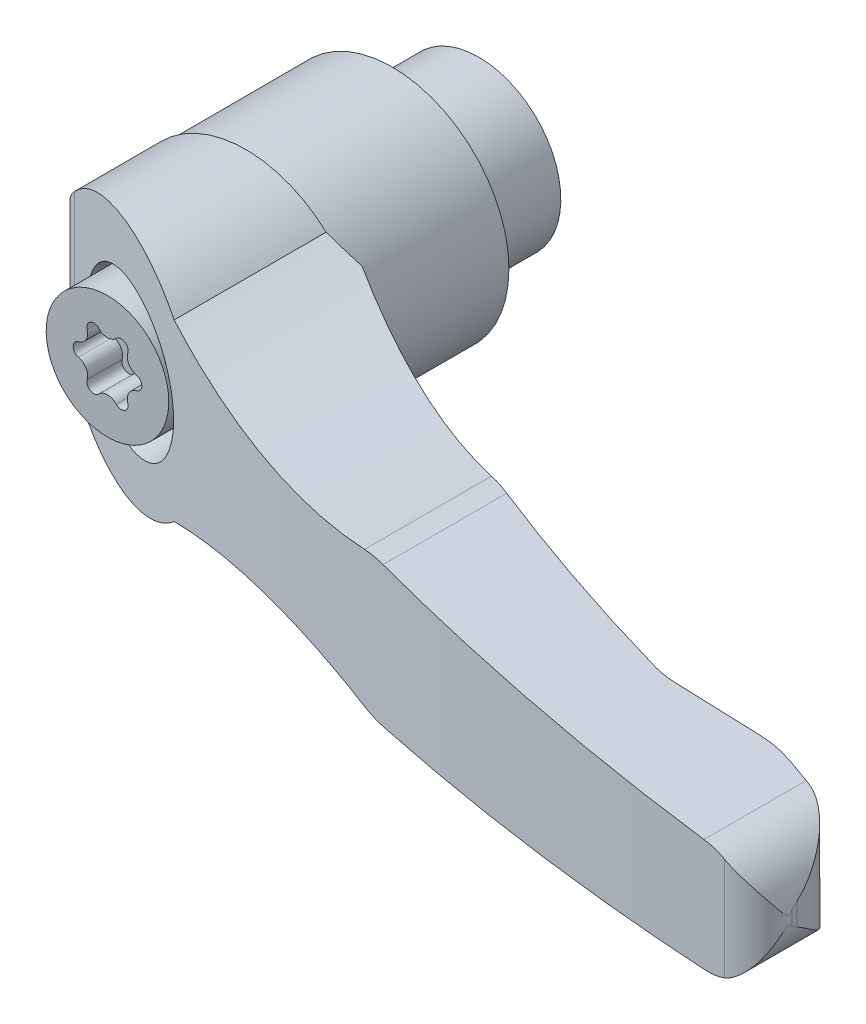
ISO-10303-21;
HEADER;
FILE_DESCRIPTION(('STEP AP214'),'2;1');
FILE_NAME('part.step','',(''),(''),'','','');
FILE_SCHEMA(('AUTOMOTIVE_DESIGN { 1 0 10303 214 1 1 1 1 }'));
ENDSEC;
DATA;
#1=APPLICATION_CONTEXT('core data for automotive mechanical design processes');
#2=APPLICATION_PROTOCOL_DEFINITION('international standard','automotive_design',2000,#1);
#3=PRODUCT_CONTEXT('',#1,'mechanical');
#4=PRODUCT('Part','Part','',(#3));
#5=PRODUCT_RELATED_PRODUCT_CATEGORY('part','',(#4));
#6=PRODUCT_DEFINITION_FORMATION('','',#4);
#7=PRODUCT_DEFINITION_CONTEXT('part definition',#1,'design');
#8=PRODUCT_DEFINITION('design','',#6,#7);
#9=PRODUCT_DEFINITION_SHAPE('','',#8);
#10=(LENGTH_UNIT() NAMED_UNIT(*) SI_UNIT(.MILLI.,.METRE.));
#11=(NAMED_UNIT(*) PLANE_ANGLE_UNIT() SI_UNIT($,.RADIAN.));
#12=(NAMED_UNIT(*) SI_UNIT($,.STERADIAN.) SOLID_ANGLE_UNIT());
#13=UNCERTAINTY_MEASURE_WITH_UNIT(LENGTH_MEASURE(1.E-05),#10,'distance_accuracy_value','');
#14=(GEOMETRIC_REPRESENTATION_CONTEXT(3) GLOBAL_UNCERTAINTY_ASSIGNED_CONTEXT((#13)) GLOBAL_UNIT_ASSIGNED_CONTEXT((#10,
#11,#12)) REPRESENTATION_CONTEXT('',''));
#15=CARTESIAN_POINT('',(0.,0.,0.));
#16=DIRECTION('',(0.,0.,1.));
#17=DIRECTION('',(1.,0.,0.));
#18=AXIS2_PLACEMENT_3D('',#15,#16,#17);
#19=CARTESIAN_POINT('',(7.75,0.,0.));
#20=DIRECTION('',(0.,0.,-1.));
#21=DIRECTION('',(0.,1.,0.));
#22=AXIS2_PLACEMENT_3D('',#19,#20,#21);
#23=PLANE('',#22);
#24=CARTESIAN_POINT('',(0.,0.,0.));
#25=DIRECTION('',(0.,0.,-1.));
#26=DIRECTION('',(-1.,0.,0.));
#27=AXIS2_PLACEMENT_3D('',#24,#25,#26);
#28=CIRCLE('',#27,6.99999999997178);
#29=CARTESIAN_POINT('',(-6.99999999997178,0.,0.));
#30=VERTEX_POINT('',#29);
#31=EDGE_CURVE('E9',#30,#30,#28,.F.);
#32=ORIENTED_EDGE('',*,*,#31,.T.);
#33=EDGE_LOOP('',(#32));
#34=FACE_BOUND('',#33,.T.);
#35=CARTESIAN_POINT('',(0.,0.,0.));
#36=DIRECTION('',(0.,0.,-1.));
#37=DIRECTION('',(0.,1.,0.));
#38=AXIS2_PLACEMENT_3D('',#35,#36,#37);
#39=CIRCLE('',#38,9.5);
#40=CARTESIAN_POINT('',(0.,9.5,0.));
#41=VERTEX_POINT('',#40);
#42=EDGE_CURVE('E280',#41,#41,#39,.F.);
#43=ORIENTED_EDGE('',*,*,#42,.F.);
#44=EDGE_LOOP('',(#43));
#45=FACE_BOUND('',#44,.T.);
#46=ADVANCED_FACE('F14',(#34,#45),#23,.T.);
#47=CARTESIAN_POINT('',(0.,0.,12.4));
#48=DIRECTION('',(0.,0.,-1.));
#49=DIRECTION('',(0.,1.,0.));
#50=AXIS2_PLACEMENT_3D('',#47,#48,#49);
#51=CYLINDRICAL_SURFACE('',#50,9.5);
#52=ORIENTED_EDGE('',*,*,#42,.T.);
#53=EDGE_LOOP('',(#52));
#54=FACE_BOUND('',#53,.T.);
#55=CARTESIAN_POINT('',(0.,0.,10.7));
#56=DIRECTION('',(0.,0.,-1.));
#57=DIRECTION('',(1.,0.,0.));
#58=AXIS2_PLACEMENT_3D('',#55,#56,#57);
#59=CIRCLE('',#58,9.5);
#60=CARTESIAN_POINT('',(9.5,0.,10.7));
#61=VERTEX_POINT('',#60);
#62=EDGE_CURVE('E282',#61,#61,#59,.T.);
#63=ORIENTED_EDGE('',*,*,#62,.T.);
#64=EDGE_LOOP('',(#63));
#65=FACE_BOUND('',#64,.T.);
#66=ADVANCED_FACE('F765',(#54,#65),#51,.T.);
#67=CARTESIAN_POINT('',(0.,0.,10.4));
#68=DIRECTION('',(0.,0.,-1.));
#69=DIRECTION('',(0.,1.,0.));
#70=AXIS2_PLACEMENT_3D('',#67,#68,#69);
#71=CONICAL_SURFACE('',#70,9.8,0.785398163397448);
#72=ORIENTED_EDGE('',*,*,#62,.F.);
#73=EDGE_LOOP('',(#72));
#74=FACE_BOUND('',#73,.T.);
#75=CARTESIAN_POINT('',(0.,0.,10.4));
#76=DIRECTION('',(0.,0.,-1.));
#77=DIRECTION('',(0.,1.,0.));
#78=AXIS2_PLACEMENT_3D('',#75,#76,#77);
#79=CIRCLE('',#78,9.8);
#80=CARTESIAN_POINT('',(0.,9.8,10.4));
#81=VERTEX_POINT('',#80);
#82=EDGE_CURVE('E227',#81,#81,#79,.T.);
#83=ORIENTED_EDGE('',*,*,#82,.T.);
#84=EDGE_LOOP('',(#83));
#85=FACE_BOUND('',#84,.T.);
#86=ADVANCED_FACE('F769',(#74,#85),#71,.F.);
#87=CARTESIAN_POINT('',(0.,0.,38.95));
#88=DIRECTION('',(0.,0.,1.));
#89=DIRECTION('',(0.,-1.,0.));
#90=AXIS2_PLACEMENT_3D('',#87,#88,#89);
#91=PLANE('',#90);
#92=CARTESIAN_POINT('',(-3.68449674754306,2.12724518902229,38.95));
#93=DIRECTION('',(0.,0.,1.));
#94=DIRECTION('',(0.,-1.,0.));
#95=AXIS2_PLACEMENT_3D('',#92,#93,#94);
#96=CIRCLE('',#95,1.39125);
#97=CARTESIAN_POINT('',(-3.36345337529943,0.77354370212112,38.95));
#98=VERTEX_POINT('',#97);
#99=CARTESIAN_POINT('',(-2.35163518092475,2.52606420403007,38.95));
#100=VERTEX_POINT('',#99);
#101=EDGE_CURVE('E274',#98,#100,#96,.T.);
#102=ORIENTED_EDGE('',*,*,#101,.F.);
#103=CARTESIAN_POINT('',(-3.18,0.,38.95));
#104=DIRECTION('',(0.,0.,1.));
#105=DIRECTION('',(0.,-1.,0.));
#106=AXIS2_PLACEMENT_3D('',#103,#104,#105);
#107=CIRCLE('',#106,0.795);
#108=CARTESIAN_POINT('',(-3.36345336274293,-0.773543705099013,38.95));
#109=VERTEX_POINT('',#108);
#110=EDGE_CURVE('E224',#98,#109,#107,.T.);
#111=ORIENTED_EDGE('',*,*,#110,.T.);
#112=CARTESIAN_POINT('',(-3.68449674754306,-2.12724518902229,38.95));
#113=DIRECTION('',(0.,0.,1.));
#114=DIRECTION('',(0.,-1.,0.));
#115=AXIS2_PLACEMENT_3D('',#112,#113,#114);
#116=CIRCLE('',#115,1.39125);
#117=CARTESIAN_POINT('',(-2.35163517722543,-2.52606419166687,38.95));
#118=VERTEX_POINT('',#117);
#119=EDGE_CURVE('E216',#118,#109,#116,.T.);
#120=ORIENTED_EDGE('',*,*,#119,.F.);
#121=CARTESIAN_POINT('',(-1.59,-2.75396078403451,38.95));
#122=DIRECTION('',(0.,0.,1.));
#123=DIRECTION('',(0.,-1.,0.));
#124=AXIS2_PLACEMENT_3D('',#121,#122,#123);
#125=CIRCLE('',#124,0.795);
#126=CARTESIAN_POINT('',(-1.01181818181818,-3.29960790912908,38.95));
#127=VERTEX_POINT('',#126);
#128=EDGE_CURVE('E222',#118,#127,#125,.T.);
#129=ORIENTED_EDGE('',*,*,#128,.T.);
#130=CARTESIAN_POINT('',(0.,-4.25449037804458,38.95));
#131=DIRECTION('',(0.,0.,1.));
#132=DIRECTION('',(0.,-1.,0.));
#133=AXIS2_PLACEMENT_3D('',#130,#131,#132);
#134=CIRCLE('',#133,1.39125);
#135=CARTESIAN_POINT('',(1.011818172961,-3.29960789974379,38.95));
#136=VERTEX_POINT('',#135);
#137=EDGE_CURVE('E237',#136,#127,#134,.T.);
#138=ORIENTED_EDGE('',*,*,#137,.F.);
#139=CARTESIAN_POINT('',(1.59,-2.75396078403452,38.95));
#140=DIRECTION('',(0.,0.,1.));
#141=DIRECTION('',(0.,-1.,0.));
#142=AXIS2_PLACEMENT_3D('',#139,#140,#141);
#143=CIRCLE('',#142,0.795);
#144=CARTESIAN_POINT('',(2.35163518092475,-2.52606420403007,38.95));
#145=VERTEX_POINT('',#144);
#146=EDGE_CURVE('E250',#136,#145,#143,.T.);
#147=ORIENTED_EDGE('',*,*,#146,.T.);
#148=CARTESIAN_POINT('',(3.68449674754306,-2.12724518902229,38.95));
#149=DIRECTION('',(0.,0.,1.));
#150=DIRECTION('',(0.,-1.,0.));
#151=AXIS2_PLACEMENT_3D('',#148,#149,#150);
#152=CIRCLE('',#151,1.39125);
#153=CARTESIAN_POINT('',(3.36345335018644,-0.773543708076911,38.95));
#154=VERTEX_POINT('',#153);
#155=EDGE_CURVE('E253',#154,#145,#152,.T.);
#156=ORIENTED_EDGE('',*,*,#155,.F.);
#157=CARTESIAN_POINT('',(3.18,0.,38.95));
#158=DIRECTION('',(0.,0.,1.));
#159=DIRECTION('',(0.,-1.,0.));
#160=AXIS2_PLACEMENT_3D('',#157,#158,#159);
#161=CIRCLE('',#160,0.795);
#162=CARTESIAN_POINT('',(3.36345336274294,0.773543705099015,38.95));
#163=VERTEX_POINT('',#162);
#164=EDGE_CURVE('E257',#154,#163,#161,.T.);
#165=ORIENTED_EDGE('',*,*,#164,.T.);
#166=CARTESIAN_POINT('',(3.68449674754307,2.12724518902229,38.95));
#167=DIRECTION('',(0.,0.,1.));
#168=DIRECTION('',(0.,-1.,0.));
#169=AXIS2_PLACEMENT_3D('',#166,#167,#168);
#170=CIRCLE('',#169,1.39125);
#171=CARTESIAN_POINT('',(2.35163518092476,2.52606420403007,38.95));
#172=VERTEX_POINT('',#171);
#173=EDGE_CURVE('E260',#172,#163,#170,.T.);
#174=ORIENTED_EDGE('',*,*,#173,.F.);
#175=CARTESIAN_POINT('',(1.59,2.75396078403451,38.95));
#176=DIRECTION('',(0.,0.,1.));
#177=DIRECTION('',(0.,-1.,0.));
#178=AXIS2_PLACEMENT_3D('',#175,#176,#177);
#179=CIRCLE('',#178,0.795);
#180=CARTESIAN_POINT('',(1.01181818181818,3.29960790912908,38.95));
#181=VERTEX_POINT('',#180);
#182=EDGE_CURVE('E264',#172,#181,#179,.T.);
#183=ORIENTED_EDGE('',*,*,#182,.T.);
#184=CARTESIAN_POINT('',(0.,4.25449037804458,38.95));
#185=DIRECTION('',(0.,0.,1.));
#186=DIRECTION('',(0.,-1.,0.));
#187=AXIS2_PLACEMENT_3D('',#184,#185,#186);
#188=CIRCLE('',#187,1.39125);
#189=CARTESIAN_POINT('',(-1.011818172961,3.29960789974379,38.95));
#190=VERTEX_POINT('',#189);
#191=EDGE_CURVE('E267',#190,#181,#188,.T.);
#192=ORIENTED_EDGE('',*,*,#191,.F.);
#193=CARTESIAN_POINT('',(-1.59,2.75396078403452,38.95));
#194=DIRECTION('',(0.,0.,1.));
#195=DIRECTION('',(0.,-1.,0.));
#196=AXIS2_PLACEMENT_3D('',#193,#194,#195);
#197=CIRCLE('',#196,0.795);
#198=EDGE_CURVE('E271',#190,#100,#197,.T.);
#199=ORIENTED_EDGE('',*,*,#198,.T.);
#200=EDGE_LOOP('',(#102,#111,#120,#129,#138,#147,#156,#165,#174,#183,#192,#199));
#201=FACE_BOUND('',#200,.T.);
#202=ADVANCED_FACE('F219',(#201),#91,.T.);
#203=CARTESIAN_POINT('',(0.,0.,9.7));
#204=DIRECTION('',(0.,0.,-1.));
#205=DIRECTION('',(0.,1.,0.));
#206=AXIS2_PLACEMENT_3D('',#203,#204,#205);
#207=CYLINDRICAL_SURFACE('',#206,9.8);
#208=ORIENTED_EDGE('',*,*,#82,.F.);
#209=EDGE_LOOP('',(#208));
#210=FACE_BOUND('',#209,.T.);
#211=CARTESIAN_POINT('',(0.,0.,10.));
#212=DIRECTION('',(0.,0.,-1.));
#213=DIRECTION('',(0.,1.,0.));
#214=AXIS2_PLACEMENT_3D('',#211,#212,#213);
#215=CIRCLE('',#214,9.8);
#216=CARTESIAN_POINT('',(0.,9.8,10.));
#217=VERTEX_POINT('',#216);
#218=EDGE_CURVE('E243',#217,#217,#215,.F.);
#219=ORIENTED_EDGE('',*,*,#218,.F.);
#220=EDGE_LOOP('',(#219));
#221=FACE_BOUND('',#220,.T.);
#222=ADVANCED_FACE('F776',(#210,#221),#207,.F.);
#223=CARTESIAN_POINT('',(-3.68449674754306,-2.12724518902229,47.05));
#224=DIRECTION('',(0.,0.,1.));
#225=DIRECTION('',(0.,-1.,0.));
#226=AXIS2_PLACEMENT_3D('',#223,#224,#225);
#227=CYLINDRICAL_SURFACE('',#226,1.39125);
#228=ORIENTED_EDGE('',*,*,#119,.T.);
#229=DIRECTION('',(0.,0.,1.));
#230=VECTOR('',#229,1.);
#231=CARTESIAN_POINT('',(-3.36345336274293,-0.773543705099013,47.05));
#232=LINE('',#231,#230);
#233=CARTESIAN_POINT('',(-3.36345336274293,-0.773543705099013,43.));
#234=VERTEX_POINT('',#233);
#235=EDGE_CURVE('E278',#109,#234,#232,.T.);
#236=ORIENTED_EDGE('',*,*,#235,.T.);
#237=CARTESIAN_POINT('',(-3.68449674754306,-2.12724518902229,43.));
#238=DIRECTION('',(0.,0.,1.));
#239=DIRECTION('',(0.,-1.,0.));
#240=AXIS2_PLACEMENT_3D('',#237,#238,#239);
#241=CIRCLE('',#240,1.39125);
#242=CARTESIAN_POINT('',(-2.35163517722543,-2.52606419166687,43.));
#243=VERTEX_POINT('',#242);
#244=EDGE_CURVE('E233',#243,#234,#241,.T.);
#245=ORIENTED_EDGE('',*,*,#244,.F.);
#246=DIRECTION('',(0.,0.,1.));
#247=VECTOR('',#246,1.);
#248=CARTESIAN_POINT('',(-2.35163517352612,-2.52606417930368,47.05));
#249=LINE('',#248,#247);
#250=EDGE_CURVE('E230',#243,#118,#249,.F.);
#251=ORIENTED_EDGE('',*,*,#250,.T.);
#252=EDGE_LOOP('',(#228,#236,#245,#251));
#253=FACE_BOUND('',#252,.T.);
#254=ADVANCED_FACE('F231',(#253),#227,.T.);
#255=CARTESIAN_POINT('',(-3.18,0.,47.05));
#256=DIRECTION('',(0.,0.,1.));
#257=DIRECTION('',(0.,-1.,0.));
#258=AXIS2_PLACEMENT_3D('',#255,#256,#257);
#259=CYLINDRICAL_SURFACE('',#258,0.795);
#260=ORIENTED_EDGE('',*,*,#235,.F.);
#261=ORIENTED_EDGE('',*,*,#110,.F.);
#262=DIRECTION('',(0.,0.,1.));
#263=VECTOR('',#262,1.);
#264=CARTESIAN_POINT('',(-3.36345338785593,0.773543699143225,47.05));
#265=LINE('',#264,#263);
#266=CARTESIAN_POINT('',(-3.36345337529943,0.77354370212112,43.));
#267=VERTEX_POINT('',#266);
#268=EDGE_CURVE('E277',#267,#98,#265,.F.);
#269=ORIENTED_EDGE('',*,*,#268,.F.);
#270=CARTESIAN_POINT('',(-3.18,0.,43.));
#271=DIRECTION('',(0.,0.,1.));
#272=DIRECTION('',(0.,-1.,0.));
#273=AXIS2_PLACEMENT_3D('',#270,#271,#272);
#274=CIRCLE('',#273,0.795);
#275=EDGE_CURVE('E884',#234,#267,#274,.F.);
#276=ORIENTED_EDGE('',*,*,#275,.F.);
#277=EDGE_LOOP('',(#260,#261,#269,#276));
#278=FACE_BOUND('',#277,.T.);
#279=ADVANCED_FACE('F782',(#278),#259,.F.);
#280=CARTESIAN_POINT('',(-3.68449674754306,2.12724518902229,47.05));
#281=DIRECTION('',(0.,0.,1.));
#282=DIRECTION('',(0.,-1.,0.));
#283=AXIS2_PLACEMENT_3D('',#280,#281,#282);
#284=CYLINDRICAL_SURFACE('',#283,1.39125);
#285=ORIENTED_EDGE('',*,*,#101,.T.);
#286=DIRECTION('',(0.,0.,1.));
#287=VECTOR('',#286,1.);
#288=CARTESIAN_POINT('',(-2.35163518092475,2.52606420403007,47.05));
#289=LINE('',#288,#287);
#290=CARTESIAN_POINT('',(-2.35163518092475,2.52606420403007,43.));
#291=VERTEX_POINT('',#290);
#292=EDGE_CURVE('E273',#100,#291,#289,.T.);
#293=ORIENTED_EDGE('',*,*,#292,.T.);
#294=CARTESIAN_POINT('',(-3.68449674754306,2.12724518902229,43.));
#295=DIRECTION('',(0.,0.,1.));
#296=DIRECTION('',(0.,-1.,0.));
#297=AXIS2_PLACEMENT_3D('',#294,#295,#296);
#298=CIRCLE('',#297,1.39125);
#299=EDGE_CURVE('E881',#267,#291,#298,.T.);
#300=ORIENTED_EDGE('',*,*,#299,.F.);
#301=ORIENTED_EDGE('',*,*,#268,.T.);
#302=EDGE_LOOP('',(#285,#293,#300,#301));
#303=FACE_BOUND('',#302,.T.);
#304=ADVANCED_FACE('F785',(#303),#284,.T.);
#305=CARTESIAN_POINT('',(-1.59,2.75396078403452,47.05));
#306=DIRECTION('',(0.,0.,1.));
#307=DIRECTION('',(0.,-1.,0.));
#308=AXIS2_PLACEMENT_3D('',#305,#306,#307);
#309=CYLINDRICAL_SURFACE('',#308,0.795);
#310=ORIENTED_EDGE('',*,*,#292,.F.);
#311=ORIENTED_EDGE('',*,*,#198,.F.);
#312=DIRECTION('',(0.,0.,1.));
#313=VECTOR('',#312,1.);
#314=CARTESIAN_POINT('',(-1.01181816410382,3.29960789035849,47.05));
#315=LINE('',#314,#313);
#316=CARTESIAN_POINT('',(-1.011818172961,3.29960789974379,43.));
#317=VERTEX_POINT('',#316);
#318=EDGE_CURVE('E270',#317,#190,#315,.F.);
#319=ORIENTED_EDGE('',*,*,#318,.F.);
#320=CARTESIAN_POINT('',(-1.59,2.75396078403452,43.));
#321=DIRECTION('',(0.,0.,1.));
#322=DIRECTION('',(0.,-1.,0.));
#323=AXIS2_PLACEMENT_3D('',#320,#321,#322);
#324=CIRCLE('',#323,0.795);
#325=EDGE_CURVE('E878',#291,#317,#324,.F.);
#326=ORIENTED_EDGE('',*,*,#325,.F.);
#327=EDGE_LOOP('',(#310,#311,#319,#326));
#328=FACE_BOUND('',#327,.T.);
#329=ADVANCED_FACE('F789',(#328),#309,.F.);
#330=CARTESIAN_POINT('',(0.,4.25449037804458,47.05));
#331=DIRECTION('',(0.,0.,1.));
#332=DIRECTION('',(0.,-1.,0.));
#333=AXIS2_PLACEMENT_3D('',#330,#331,#332);
#334=CYLINDRICAL_SURFACE('',#333,1.39125);
#335=ORIENTED_EDGE('',*,*,#191,.T.);
#336=DIRECTION('',(0.,0.,1.));
#337=VECTOR('',#336,1.);
#338=CARTESIAN_POINT('',(1.01181818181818,3.29960790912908,47.05));
#339=LINE('',#338,#337);
#340=CARTESIAN_POINT('',(1.01181818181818,3.29960790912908,43.));
#341=VERTEX_POINT('',#340);
#342=EDGE_CURVE('E266',#181,#341,#339,.T.);
#343=ORIENTED_EDGE('',*,*,#342,.T.);
#344=CARTESIAN_POINT('',(0.,4.25449037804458,43.));
#345=DIRECTION('',(0.,0.,1.));
#346=DIRECTION('',(0.,-1.,0.));
#347=AXIS2_PLACEMENT_3D('',#344,#345,#346);
#348=CIRCLE('',#347,1.39125);
#349=EDGE_CURVE('E875',#317,#341,#348,.T.);
#350=ORIENTED_EDGE('',*,*,#349,.F.);
#351=ORIENTED_EDGE('',*,*,#318,.T.);
#352=EDGE_LOOP('',(#335,#343,#350,#351));
#353=FACE_BOUND('',#352,.T.);
#354=ADVANCED_FACE('F793',(#353),#334,.T.);
#355=CARTESIAN_POINT('',(1.59,2.75396078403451,47.05));
#356=DIRECTION('',(0.,0.,1.));
#357=DIRECTION('',(0.,-1.,0.));
#358=AXIS2_PLACEMENT_3D('',#355,#356,#357);
#359=CYLINDRICAL_SURFACE('',#358,0.795);
#360=ORIENTED_EDGE('',*,*,#342,.F.);
#361=ORIENTED_EDGE('',*,*,#182,.F.);
#362=DIRECTION('',(0.,0.,1.));
#363=VECTOR('',#362,1.);
#364=CARTESIAN_POINT('',(2.35163518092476,2.52606420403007,47.05));
#365=LINE('',#364,#363);
#366=CARTESIAN_POINT('',(2.35163518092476,2.52606420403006,43.));
#367=VERTEX_POINT('',#366);
#368=EDGE_CURVE('E263',#367,#172,#365,.F.);
#369=ORIENTED_EDGE('',*,*,#368,.F.);
#370=CARTESIAN_POINT('',(1.59,2.75396078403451,43.));
#371=DIRECTION('',(0.,0.,1.));
#372=DIRECTION('',(0.,-1.,0.));
#373=AXIS2_PLACEMENT_3D('',#370,#371,#372);
#374=CIRCLE('',#373,0.795);
#375=EDGE_CURVE('E872',#341,#367,#374,.F.);
#376=ORIENTED_EDGE('',*,*,#375,.F.);
#377=EDGE_LOOP('',(#360,#361,#369,#376));
#378=FACE_BOUND('',#377,.T.);
#379=ADVANCED_FACE('F797',(#378),#359,.F.);
#380=CARTESIAN_POINT('',(3.68449674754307,2.12724518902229,47.05));
#381=DIRECTION('',(0.,0.,1.));
#382=DIRECTION('',(0.,-1.,0.));
#383=AXIS2_PLACEMENT_3D('',#380,#381,#382);
#384=CYLINDRICAL_SURFACE('',#383,1.39125);
#385=ORIENTED_EDGE('',*,*,#173,.T.);
#386=DIRECTION('',(0.,0.,1.));
#387=VECTOR('',#386,1.);
#388=CARTESIAN_POINT('',(3.36345336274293,0.773543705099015,47.05));
#389=LINE('',#388,#387);
#390=CARTESIAN_POINT('',(3.36345336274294,0.773543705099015,43.));
#391=VERTEX_POINT('',#390);
#392=EDGE_CURVE('E259',#163,#391,#389,.T.);
#393=ORIENTED_EDGE('',*,*,#392,.T.);
#394=CARTESIAN_POINT('',(3.68449674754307,2.12724518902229,43.));
#395=DIRECTION('',(0.,0.,1.));
#396=DIRECTION('',(0.,-1.,0.));
#397=AXIS2_PLACEMENT_3D('',#394,#395,#396);
#398=CIRCLE('',#397,1.39125);
#399=EDGE_CURVE('E869',#367,#391,#398,.T.);
#400=ORIENTED_EDGE('',*,*,#399,.F.);
#401=ORIENTED_EDGE('',*,*,#368,.T.);
#402=EDGE_LOOP('',(#385,#393,#400,#401));
#403=FACE_BOUND('',#402,.T.);
#404=ADVANCED_FACE('F801',(#403),#384,.T.);
#405=CARTESIAN_POINT('',(3.18,0.,47.05));
#406=DIRECTION('',(0.,0.,1.));
#407=DIRECTION('',(0.,-1.,0.));
#408=AXIS2_PLACEMENT_3D('',#405,#406,#407);
#409=CYLINDRICAL_SURFACE('',#408,0.795);
#410=ORIENTED_EDGE('',*,*,#392,.F.);
#411=ORIENTED_EDGE('',*,*,#164,.F.);
#412=DIRECTION('',(0.,0.,1.));
#413=VECTOR('',#412,1.);
#414=CARTESIAN_POINT('',(3.36345333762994,-0.773543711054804,47.05));
#415=LINE('',#414,#413);
#416=CARTESIAN_POINT('',(3.36345335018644,-0.77354370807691,43.));
#417=VERTEX_POINT('',#416);
#418=EDGE_CURVE('E256',#417,#154,#415,.F.);
#419=ORIENTED_EDGE('',*,*,#418,.F.);
#420=CARTESIAN_POINT('',(3.18,0.,43.));
#421=DIRECTION('',(0.,0.,1.));
#422=DIRECTION('',(0.,-1.,0.));
#423=AXIS2_PLACEMENT_3D('',#420,#421,#422);
#424=CIRCLE('',#423,0.795);
#425=EDGE_CURVE('E866',#391,#417,#424,.F.);
#426=ORIENTED_EDGE('',*,*,#425,.F.);
#427=EDGE_LOOP('',(#410,#411,#419,#426));
#428=FACE_BOUND('',#427,.T.);
#429=ADVANCED_FACE('F805',(#428),#409,.F.);
#430=CARTESIAN_POINT('',(3.68449674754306,-2.12724518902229,47.05));
#431=DIRECTION('',(0.,0.,1.));
#432=DIRECTION('',(0.,-1.,0.));
#433=AXIS2_PLACEMENT_3D('',#430,#431,#432);
#434=CYLINDRICAL_SURFACE('',#433,1.39125);
#435=ORIENTED_EDGE('',*,*,#155,.T.);
#436=DIRECTION('',(0.,0.,1.));
#437=VECTOR('',#436,1.);
#438=CARTESIAN_POINT('',(2.35163518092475,-2.52606420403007,47.05));
#439=LINE('',#438,#437);
#440=CARTESIAN_POINT('',(2.35163518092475,-2.52606420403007,43.));
#441=VERTEX_POINT('',#440);
#442=EDGE_CURVE('E252',#145,#441,#439,.T.);
#443=ORIENTED_EDGE('',*,*,#442,.T.);
#444=CARTESIAN_POINT('',(3.68449674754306,-2.12724518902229,43.));
#445=DIRECTION('',(0.,0.,1.));
#446=DIRECTION('',(0.,-1.,0.));
#447=AXIS2_PLACEMENT_3D('',#444,#445,#446);
#448=CIRCLE('',#447,1.39125);
#449=EDGE_CURVE('E863',#417,#441,#448,.T.);
#450=ORIENTED_EDGE('',*,*,#449,.F.);
#451=ORIENTED_EDGE('',*,*,#418,.T.);
#452=EDGE_LOOP('',(#435,#443,#450,#451));
#453=FACE_BOUND('',#452,.T.);
#454=ADVANCED_FACE('F809',(#453),#434,.T.);
#455=CARTESIAN_POINT('',(1.59,-2.75396078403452,47.05));
#456=DIRECTION('',(0.,0.,1.));
#457=DIRECTION('',(0.,-1.,0.));
#458=AXIS2_PLACEMENT_3D('',#455,#456,#457);
#459=CYLINDRICAL_SURFACE('',#458,0.795);
#460=ORIENTED_EDGE('',*,*,#442,.F.);
#461=ORIENTED_EDGE('',*,*,#146,.F.);
#462=DIRECTION('',(0.,0.,1.));
#463=VECTOR('',#462,1.);
#464=CARTESIAN_POINT('',(1.01181816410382,-3.29960789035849,47.05));
#465=LINE('',#464,#463);
#466=CARTESIAN_POINT('',(1.011818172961,-3.29960789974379,43.));
#467=VERTEX_POINT('',#466);
#468=EDGE_CURVE('E249',#467,#136,#465,.F.);
#469=ORIENTED_EDGE('',*,*,#468,.F.);
#470=CARTESIAN_POINT('',(1.59,-2.75396078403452,43.));
#471=DIRECTION('',(0.,0.,1.));
#472=DIRECTION('',(0.,-1.,0.));
#473=AXIS2_PLACEMENT_3D('',#470,#471,#472);
#474=CIRCLE('',#473,0.795);
#475=EDGE_CURVE('E860',#441,#467,#474,.F.);
#476=ORIENTED_EDGE('',*,*,#475,.F.);
#477=EDGE_LOOP('',(#460,#461,#469,#476));
#478=FACE_BOUND('',#477,.T.);
#479=ADVANCED_FACE('F813',(#478),#459,.F.);
#480=CARTESIAN_POINT('',(0.,-4.25449037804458,47.05));
#481=DIRECTION('',(0.,0.,1.));
#482=DIRECTION('',(0.,-1.,0.));
#483=AXIS2_PLACEMENT_3D('',#480,#481,#482);
#484=CYLINDRICAL_SURFACE('',#483,1.39125);
#485=ORIENTED_EDGE('',*,*,#137,.T.);
#486=DIRECTION('',(0.,0.,1.));
#487=VECTOR('',#486,1.);
#488=CARTESIAN_POINT('',(-1.01181818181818,-3.29960790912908,47.05));
#489=LINE('',#488,#487);
#490=CARTESIAN_POINT('',(-1.01181818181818,-3.29960790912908,43.));
#491=VERTEX_POINT('',#490);
#492=EDGE_CURVE('E241',#127,#491,#489,.T.);
#493=ORIENTED_EDGE('',*,*,#492,.T.);
#494=CARTESIAN_POINT('',(0.,-4.25449037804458,43.));
#495=DIRECTION('',(0.,0.,1.));
#496=DIRECTION('',(0.,-1.,0.));
#497=AXIS2_PLACEMENT_3D('',#494,#495,#496);
#498=CIRCLE('',#497,1.39125);
#499=EDGE_CURVE('E857',#467,#491,#498,.T.);
#500=ORIENTED_EDGE('',*,*,#499,.F.);
#501=ORIENTED_EDGE('',*,*,#468,.T.);
#502=EDGE_LOOP('',(#485,#493,#500,#501));
#503=FACE_BOUND('',#502,.T.);
#504=ADVANCED_FACE('F817',(#503),#484,.T.);
#505=CARTESIAN_POINT('',(-1.59,-2.75396078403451,47.05));
#506=DIRECTION('',(0.,0.,1.));
#507=DIRECTION('',(0.,-1.,0.));
#508=AXIS2_PLACEMENT_3D('',#505,#506,#507);
#509=CYLINDRICAL_SURFACE('',#508,0.795);
#510=ORIENTED_EDGE('',*,*,#492,.F.);
#511=ORIENTED_EDGE('',*,*,#128,.F.);
#512=ORIENTED_EDGE('',*,*,#250,.F.);
#513=CARTESIAN_POINT('',(-1.59,-2.75396078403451,43.));
#514=DIRECTION('',(0.,0.,1.));
#515=DIRECTION('',(0.,-1.,0.));
#516=AXIS2_PLACEMENT_3D('',#513,#514,#515);
#517=CIRCLE('',#516,0.795);
#518=EDGE_CURVE('E855',#491,#243,#517,.F.);
#519=ORIENTED_EDGE('',*,*,#518,.F.);
#520=EDGE_LOOP('',(#510,#511,#512,#519));
#521=FACE_BOUND('',#520,.T.);
#522=ADVANCED_FACE('F240',(#521),#509,.F.);
#523=CARTESIAN_POINT('',(-13.2600377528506,-27.5,10.));
#524=DIRECTION('',(0.707106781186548,0.,0.707106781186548));
#525=DIRECTION('',(-0.707106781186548,0.,0.707106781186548));
#526=AXIS2_PLACEMENT_3D('',#523,#524,#525);
#527=PLANE('',#526);
#528=DIRECTION('',(0.,1.,0.));
#529=VECTOR('',#528,1.);
#530=CARTESIAN_POINT('',(-13.2600377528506,0.,10.));
#531=LINE('',#530,#529);
#532=CARTESIAN_POINT('',(-13.2600377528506,-2.58582666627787,10.));
#533=VERTEX_POINT('',#532);
#534=CARTESIAN_POINT('',(-13.2600377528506,2.58582666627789,10.));
#535=VERTEX_POINT('',#534);
#536=EDGE_CURVE('E750',#533,#535,#531,.T.);
#537=ORIENTED_EDGE('',*,*,#536,.F.);
#538=CARTESIAN_POINT('',(-0.00999999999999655,0.,-3.25003775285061));
#539=DIRECTION('',(0.707106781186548,0.,0.707106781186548));
#540=DIRECTION('',(-0.707106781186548,0.,0.707106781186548));
#541=AXIS2_PLACEMENT_3D('',#538,#539,#540);
#542=ELLIPSE('',#541,19.0918830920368,13.5);
#543=EDGE_CURVE('E853',#535,#533,#542,.T.);
#544=ORIENTED_EDGE('',*,*,#543,.F.);
#545=EDGE_LOOP('',(#537,#544));
#546=FACE_BOUND('',#545,.T.);
#547=ADVANCED_FACE('F824',(#546),#527,.F.);
#548=CARTESIAN_POINT('',(-6.76,0.,10.));
#549=DIRECTION('',(0.,0.,-1.));
#550=DIRECTION('',(0.,1.,0.));
#551=AXIS2_PLACEMENT_3D('',#548,#549,#550);
#552=PLANE('',#551);
#553=ORIENTED_EDGE('',*,*,#536,.T.);
#554=CARTESIAN_POINT('',(-0.00999999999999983,0.,10.));
#555=DIRECTION('',(0.,0.,1.));
#556=DIRECTION('',(-1.,0.,0.));
#557=AXIS2_PLACEMENT_3D('',#554,#555,#556);
#558=CIRCLE('',#557,13.5);
#559=EDGE_CURVE('E843',#533,#535,#558,.T.);
#560=ORIENTED_EDGE('',*,*,#559,.F.);
#561=EDGE_LOOP('',(#553,#560));
#562=FACE_BOUND('',#561,.T.);
#563=ORIENTED_EDGE('',*,*,#218,.T.);
#564=EDGE_LOOP('',(#563));
#565=FACE_BOUND('',#564,.T.);
#566=ADVANCED_FACE('F827',(#562,#565),#552,.T.);
#567=CARTESIAN_POINT('',(3.55,0.,43.));
#568=DIRECTION('',(0.,0.,1.));
#569=DIRECTION('',(0.,-1.,0.));
#570=AXIS2_PLACEMENT_3D('',#567,#568,#569);
#571=PLANE('',#570);
#572=CARTESIAN_POINT('',(0.,0.,43.));
#573=DIRECTION('',(0.,0.,-1.));
#574=DIRECTION('',(0.,1.,0.));
#575=AXIS2_PLACEMENT_3D('',#572,#573,#574);
#576=CIRCLE('',#575,7.1);
#577=CARTESIAN_POINT('',(0.,7.1,43.));
#578=VERTEX_POINT('',#577);
#579=EDGE_CURVE('E847',#578,#578,#576,.T.);
#580=ORIENTED_EDGE('',*,*,#579,.F.);
#581=EDGE_LOOP('',(#580));
#582=FACE_BOUND('',#581,.T.);
#583=ORIENTED_EDGE('',*,*,#499,.T.);
#584=ORIENTED_EDGE('',*,*,#518,.T.);
#585=ORIENTED_EDGE('',*,*,#244,.T.);
#586=ORIENTED_EDGE('',*,*,#275,.T.);
#587=ORIENTED_EDGE('',*,*,#299,.T.);
#588=ORIENTED_EDGE('',*,*,#325,.T.);
#589=ORIENTED_EDGE('',*,*,#349,.T.);
#590=ORIENTED_EDGE('',*,*,#375,.T.);
#591=ORIENTED_EDGE('',*,*,#399,.T.);
#592=ORIENTED_EDGE('',*,*,#425,.T.);
#593=ORIENTED_EDGE('',*,*,#449,.T.);
#594=ORIENTED_EDGE('',*,*,#475,.T.);
#595=EDGE_LOOP('',(#583,#584,#585,#586,#587,#588,#589,#590,#591,#592,#593,#594));
#596=FACE_BOUND('',#595,.T.);
#597=ADVANCED_FACE('F831',(#582,#596),#571,.T.);
#598=CARTESIAN_POINT('',(-0.0100000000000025,0.,20.75));
#599=DIRECTION('',(0.,0.,1.));
#600=DIRECTION('',(-1.,0.,0.));
#601=AXIS2_PLACEMENT_3D('',#598,#599,#600);
#602=CYLINDRICAL_SURFACE('',#601,13.5);
#603=ORIENTED_EDGE('',*,*,#559,.T.);
#604=ORIENTED_EDGE('',*,*,#543,.T.);
#605=EDGE_LOOP('',(#603,#604));
#606=FACE_BOUND('',#605,.T.);
#607=CARTESIAN_POINT('',(-0.010000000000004,0.,27.));
#608=DIRECTION('',(0.,0.,1.));
#609=DIRECTION('',(-1.,0.,0.));
#610=AXIS2_PLACEMENT_3D('',#607,#608,#609);
#611=CIRCLE('',#610,13.5);
#612=CARTESIAN_POINT('',(-13.51,0.,27.));
#613=VERTEX_POINT('',#612);
#614=CARTESIAN_POINT('',(13.4899999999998,0.,27.));
#615=VERTEX_POINT('',#614);
#616=EDGE_CURVE('E316',#613,#615,#611,.T.);
#617=ORIENTED_EDGE('',*,*,#616,.F.);
#618=CARTESIAN_POINT('',(-0.010000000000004,0.,27.));
#619=DIRECTION('',(0.,0.,1.));
#620=DIRECTION('',(-1.,0.,0.));
#621=AXIS2_PLACEMENT_3D('',#618,#619,#620);
#622=CIRCLE('',#621,13.5);
#623=EDGE_CURVE('E321',#615,#613,#622,.T.);
#624=ORIENTED_EDGE('',*,*,#623,.F.);
#625=EDGE_LOOP('',(#617,#624));
#626=FACE_BOUND('',#625,.T.);
#627=ADVANCED_FACE('F588',(#606,#626),#602,.T.);
#628=CARTESIAN_POINT('',(94.8688366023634,-14.75,58.0130023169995));
#629=DIRECTION('',(0.992331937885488,0.,-0.123601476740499));
#630=DIRECTION('',(0.123601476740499,0.,0.992331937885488));
#631=AXIS2_PLACEMENT_3D('',#628,#629,#630);
#632=PLANE('',#631);
#633=CARTESIAN_POINT('',(88.5,0.,6.88092740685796));
#634=DIRECTION('',(0.992331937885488,0.,-0.123601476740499));
#635=DIRECTION('',(0.123601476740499,0.,0.992331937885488));
#636=AXIS2_PLACEMENT_3D('',#633,#634,#635);
#637=ELLIPSE('',#636,52.588368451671,6.5);
#638=CARTESIAN_POINT('',(94.9511621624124,-0.795302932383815,58.6739513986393));
#639=VERTEX_POINT('',#638);
#640=CARTESIAN_POINT('',(94.8688366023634,-1.29919988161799,58.0130023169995));
#641=VERTEX_POINT('',#640);
#642=EDGE_CURVE('E748',#639,#641,#637,.T.);
#643=ORIENTED_EDGE('',*,*,#642,.T.);
#644=DIRECTION('',(0.,-1.,0.));
#645=VECTOR('',#644,1.);
#646=CARTESIAN_POINT('',(94.8688366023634,-14.75,58.0130023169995));
#647=LINE('',#646,#645);
#648=CARTESIAN_POINT('',(94.8688366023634,1.29919988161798,58.0130023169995));
#649=VERTEX_POINT('',#648);
#650=EDGE_CURVE('E308',#649,#641,#647,.T.);
#651=ORIENTED_EDGE('',*,*,#650,.F.);
#652=CARTESIAN_POINT('',(88.5,0.,6.88092740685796));
#653=DIRECTION('',(0.992331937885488,0.,-0.123601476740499));
#654=DIRECTION('',(0.123601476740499,0.,0.992331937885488));
#655=AXIS2_PLACEMENT_3D('',#652,#653,#654);
#656=ELLIPSE('',#655,52.588368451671,6.5);
#657=CARTESIAN_POINT('',(94.9511621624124,0.795302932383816,58.6739513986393));
#658=VERTEX_POINT('',#657);
#659=EDGE_CURVE('E749',#649,#658,#656,.T.);
#660=ORIENTED_EDGE('',*,*,#659,.T.);
#661=DIRECTION('',(0.,-1.,0.));
#662=VECTOR('',#661,1.);
#663=CARTESIAN_POINT('',(94.9511621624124,-14.75,58.6739513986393));
#664=LINE('',#663,#662);
#665=EDGE_CURVE('E745',#658,#639,#664,.T.);
#666=ORIENTED_EDGE('',*,*,#665,.T.);
#667=EDGE_LOOP('',(#643,#651,#660,#666));
#668=FACE_BOUND('',#667,.T.);
#669=ADVANCED_FACE('F578',(#668),#632,.T.);
#670=CARTESIAN_POINT('',(0.,0.,39.8295));
#671=DIRECTION('',(0.,0.,-1.));
#672=DIRECTION('',(0.,1.,0.));
#673=AXIS2_PLACEMENT_3D('',#670,#671,#672);
#674=CYLINDRICAL_SURFACE('',#673,7.1);
#675=ORIENTED_EDGE('',*,*,#579,.T.);
#676=EDGE_LOOP('',(#675));
#677=FACE_BOUND('',#676,.T.);
#678=CARTESIAN_POINT('',(0.,0.,36.66));
#679=DIRECTION('',(0.,0.,1.));
#680=DIRECTION('',(1.,0.,0.));
#681=AXIS2_PLACEMENT_3D('',#678,#679,#680);
#682=CIRCLE('',#681,7.1);
#683=CARTESIAN_POINT('',(7.1,0.,36.66));
#684=VERTEX_POINT('',#683);
#685=EDGE_CURVE('E322',#684,#684,#682,.T.);
#686=ORIENTED_EDGE('',*,*,#685,.T.);
#687=EDGE_LOOP('',(#686));
#688=FACE_BOUND('',#687,.T.);
#689=ADVANCED_FACE('F575',(#677,#688),#674,.T.);
#690=CARTESIAN_POINT('',(-13.51,-14.75,27.));
#691=DIRECTION('',(0.,0.,-1.));
#692=DIRECTION('',(0.,1.,0.));
#693=AXIS2_PLACEMENT_3D('',#690,#691,#692);
#694=PLANE('',#693);
#695=DIRECTION('',(0.,-1.,0.));
#696=VECTOR('',#695,1.);
#697=CARTESIAN_POINT('',(-13.51,-14.75,27.));
#698=LINE('',#697,#696);
#699=CARTESIAN_POINT('',(-13.51,2.55781156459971,27.));
#700=VERTEX_POINT('',#699);
#701=EDGE_CURVE('E317',#700,#613,#698,.T.);
#702=ORIENTED_EDGE('',*,*,#701,.F.);
#703=CARTESIAN_POINT('',(0.,0.,27.));
#704=DIRECTION('',(0.,0.,1.));
#705=DIRECTION('',(0.,-1.,0.));
#706=AXIS2_PLACEMENT_3D('',#703,#704,#705);
#707=CIRCLE('',#706,13.75);
#708=CARTESIAN_POINT('',(9.32365402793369,10.1060365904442,27.));
#709=VERTEX_POINT('',#708);
#710=EDGE_CURVE('E492',#709,#700,#707,.T.);
#711=ORIENTED_EDGE('',*,*,#710,.F.);
#712=CARTESIAN_POINT('',(29.15,64.91,27.));
#713=DIRECTION('',(0.,0.,1.));
#714=DIRECTION('',(0.,-1.,0.));
#715=AXIS2_PLACEMENT_3D('',#712,#713,#714);
#716=CIRCLE('',#715,58.28);
#717=CARTESIAN_POINT('',(13.4899999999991,8.77335599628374,27.));
#718=VERTEX_POINT('',#717);
#719=EDGE_CURVE('E454',#709,#718,#716,.T.);
#720=ORIENTED_EDGE('',*,*,#719,.T.);
#721=DIRECTION('',(0.,-1.,0.));
#722=VECTOR('',#721,1.);
#723=CARTESIAN_POINT('',(13.4899999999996,-14.75,27.0000000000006));
#724=LINE('',#723,#722);
#725=EDGE_CURVE('E312',#718,#615,#724,.T.);
#726=ORIENTED_EDGE('',*,*,#725,.T.);
#727=ORIENTED_EDGE('',*,*,#623,.T.);
#728=EDGE_LOOP('',(#702,#711,#720,#726,#727));
#729=FACE_BOUND('',#728,.T.);
#730=ADVANCED_FACE('F577',(#729),#694,.T.);
#731=CARTESIAN_POINT('',(-13.51,-14.75,31.4135672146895));
#732=DIRECTION('',(-1.,0.,0.));
#733=DIRECTION('',(0.,-1.,0.));
#734=AXIS2_PLACEMENT_3D('',#731,#732,#733);
#735=PLANE('',#734);
#736=DIRECTION('',(0.,0.,1.));
#737=VECTOR('',#736,1.);
#738=CARTESIAN_POINT('',(-13.51,-2.5578115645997,63.));
#739=LINE('',#738,#737);
#740=CARTESIAN_POINT('',(-13.51,-2.55781156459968,31.4135672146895));
#741=VERTEX_POINT('',#740);
#742=CARTESIAN_POINT('',(-13.51,-2.55781156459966,27.));
#743=VERTEX_POINT('',#742);
#744=EDGE_CURVE('E320',#741,#743,#739,.F.);
#745=ORIENTED_EDGE('',*,*,#744,.F.);
#746=DIRECTION('',(0.,-1.,0.));
#747=VECTOR('',#746,1.);
#748=CARTESIAN_POINT('',(-13.51,-14.75,31.4135672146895));
#749=LINE('',#748,#747);
#750=CARTESIAN_POINT('',(-13.51,2.55781156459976,31.4135672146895));
#751=VERTEX_POINT('',#750);
#752=EDGE_CURVE('E506',#751,#741,#749,.T.);
#753=ORIENTED_EDGE('',*,*,#752,.F.);
#754=DIRECTION('',(0.,0.,1.));
#755=VECTOR('',#754,1.);
#756=CARTESIAN_POINT('',(-13.51,2.55781156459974,63.));
#757=LINE('',#756,#755);
#758=EDGE_CURVE('E495',#700,#751,#757,.T.);
#759=ORIENTED_EDGE('',*,*,#758,.F.);
#760=ORIENTED_EDGE('',*,*,#701,.T.);
#761=DIRECTION('',(0.,1.,0.));
#762=VECTOR('',#761,1.);
#763=CARTESIAN_POINT('',(-13.51,-14.75,27.));
#764=LINE('',#763,#762);
#765=EDGE_CURVE('E730',#743,#613,#764,.T.);
#766=ORIENTED_EDGE('',*,*,#765,.F.);
#767=EDGE_LOOP('',(#745,#753,#759,#760,#766));
#768=FACE_BOUND('',#767,.T.);
#769=ADVANCED_FACE('F585',(#768),#735,.T.);
#770=CARTESIAN_POINT('',(-13.51,-14.75,27.));
#771=DIRECTION('',(0.,0.,-1.));
#772=DIRECTION('',(0.,1.,0.));
#773=AXIS2_PLACEMENT_3D('',#770,#771,#772);
#774=PLANE('',#773);
#775=ORIENTED_EDGE('',*,*,#616,.T.);
#776=DIRECTION('',(0.,-1.,0.));
#777=VECTOR('',#776,1.);
#778=CARTESIAN_POINT('',(13.4899999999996,-14.75,27.0000000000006));
#779=LINE('',#778,#777);
#780=CARTESIAN_POINT('',(13.4899999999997,-8.77335599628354,27.));
#781=VERTEX_POINT('',#780);
#782=EDGE_CURVE('E721',#615,#781,#779,.T.);
#783=ORIENTED_EDGE('',*,*,#782,.T.);
#784=CARTESIAN_POINT('',(29.15,-64.91,27.));
#785=DIRECTION('',(0.,0.,1.));
#786=DIRECTION('',(0.,-1.,0.));
#787=AXIS2_PLACEMENT_3D('',#784,#785,#786);
#788=CIRCLE('',#787,58.28);
#789=CARTESIAN_POINT('',(9.32365402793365,-10.1060365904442,27.));
#790=VERTEX_POINT('',#789);
#791=EDGE_CURVE('E717',#781,#790,#788,.T.);
#792=ORIENTED_EDGE('',*,*,#791,.T.);
#793=CARTESIAN_POINT('',(0.,0.,27.));
#794=DIRECTION('',(0.,0.,1.));
#795=DIRECTION('',(0.,-1.,0.));
#796=AXIS2_PLACEMENT_3D('',#793,#794,#795);
#797=CIRCLE('',#796,13.75);
#798=EDGE_CURVE('E716',#743,#790,#797,.T.);
#799=ORIENTED_EDGE('',*,*,#798,.F.);
#800=ORIENTED_EDGE('',*,*,#765,.T.);
#801=EDGE_LOOP('',(#775,#783,#792,#799,#800));
#802=FACE_BOUND('',#801,.T.);
#803=ADVANCED_FACE('F596',(#802),#774,.T.);
#804=CARTESIAN_POINT('',(81.4673032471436,-14.75,62.36));
#805=DIRECTION('',(0.,-1.,0.));
#806=DIRECTION('',(1.,0.,0.));
#807=AXIS2_PLACEMENT_3D('',#804,#805,#806);
#808=CYLINDRICAL_SURFACE('',#807,13.39);
#809=CARTESIAN_POINT('',(81.4673032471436,-6.75541913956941,62.36));
#810=DIRECTION('',(-0.0362948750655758,0.999341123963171,0.));
#811=DIRECTION('',(-0.999341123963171,-0.0362948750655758,0.));
#812=AXIS2_PLACEMENT_3D('',#809,#810,#811);
#813=ELLIPSE('',#812,13.3988281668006,13.39);
#814=CARTESIAN_POINT('',(85.7182287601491,-6.60103060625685,49.6626879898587));
#815=VERTEX_POINT('',#814);
#816=CARTESIAN_POINT('',(81.4673032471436,-6.75541913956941,48.97));
#817=VERTEX_POINT('',#816);
#818=EDGE_CURVE('E620',#815,#817,#813,.T.);
#819=ORIENTED_EDGE('',*,*,#818,.T.);
#820=DIRECTION('',(0.,1.,0.));
#821=VECTOR('',#820,1.);
#822=CARTESIAN_POINT('',(81.4673032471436,-14.75,48.97));
#823=LINE('',#822,#821);
#824=CARTESIAN_POINT('',(81.4673032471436,6.75541913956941,48.97));
#825=VERTEX_POINT('',#824);
#826=EDGE_CURVE('E313',#825,#817,#823,.F.);
#827=ORIENTED_EDGE('',*,*,#826,.F.);
#828=CARTESIAN_POINT('',(81.4673032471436,6.75541913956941,62.36));
#829=DIRECTION('',(-0.0362948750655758,-0.999341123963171,0.));
#830=DIRECTION('',(0.999341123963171,-0.0362948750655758,0.));
#831=AXIS2_PLACEMENT_3D('',#828,#829,#830);
#832=ELLIPSE('',#831,13.3988281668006,13.39);
#833=CARTESIAN_POINT('',(85.7182287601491,6.60103060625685,49.6626879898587));
#834=VERTEX_POINT('',#833);
#835=EDGE_CURVE('E456',#825,#834,#832,.T.);
#836=ORIENTED_EDGE('',*,*,#835,.T.);
#837=DIRECTION('',(0.,-1.,0.));
#838=VECTOR('',#837,1.);
#839=CARTESIAN_POINT('',(85.7182287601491,-14.75,49.6626879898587));
#840=LINE('',#839,#838);
#841=EDGE_CURVE('E305',#815,#834,#840,.F.);
#842=ORIENTED_EDGE('',*,*,#841,.F.);
#843=EDGE_LOOP('',(#819,#827,#836,#842));
#844=FACE_BOUND('',#843,.T.);
#845=ADVANCED_FACE('F600',(#844),#808,.T.);
#846=CARTESIAN_POINT('',(71.6523269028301,-14.75,48.97));
#847=DIRECTION('',(0.,0.,-1.));
#848=DIRECTION('',(0.,1.,0.));
#849=AXIS2_PLACEMENT_3D('',#846,#847,#848);
#850=PLANE('',#849);
#851=DIRECTION('',(-0.999341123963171,-0.0362948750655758,0.));
#852=VECTOR('',#851,1.);
#853=CARTESIAN_POINT('',(88.5,-6.5,48.97));
#854=LINE('',#853,#852);
#855=CARTESIAN_POINT('',(71.6523269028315,-7.11188734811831,48.97));
#856=VERTEX_POINT('',#855);
#857=EDGE_CURVE('E612',#817,#856,#854,.T.);
#858=ORIENTED_EDGE('',*,*,#857,.T.);
#859=DIRECTION('',(0.,-1.,0.));
#860=VECTOR('',#859,1.);
#861=CARTESIAN_POINT('',(71.6523269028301,-14.75,48.97));
#862=LINE('',#861,#860);
#863=CARTESIAN_POINT('',(71.6523269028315,7.11188734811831,48.97));
#864=VERTEX_POINT('',#863);
#865=EDGE_CURVE('E310',#856,#864,#862,.F.);
#866=ORIENTED_EDGE('',*,*,#865,.T.);
#867=DIRECTION('',(0.999341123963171,-0.0362948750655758,0.));
#868=VECTOR('',#867,1.);
#869=CARTESIAN_POINT('',(43.9670619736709,8.1173830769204,48.97));
#870=LINE('',#869,#868);
#871=EDGE_CURVE('E740',#864,#825,#870,.T.);
#872=ORIENTED_EDGE('',*,*,#871,.T.);
#873=ORIENTED_EDGE('',*,*,#826,.T.);
#874=EDGE_LOOP('',(#858,#866,#872,#873));
#875=FACE_BOUND('',#874,.T.);
#876=ADVANCED_FACE('F603',(#875),#850,.T.);
#877=CARTESIAN_POINT('',(71.6523269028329,-14.75,38.8899999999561));
#878=DIRECTION('',(0.,-1.,0.));
#879=DIRECTION('',(1.,0.,0.));
#880=AXIS2_PLACEMENT_3D('',#877,#878,#879);
#881=CYLINDRICAL_SURFACE('',#880,10.0800000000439);
#882=ORIENTED_EDGE('',*,*,#865,.F.);
#883=CARTESIAN_POINT('',(71.6523269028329,-7.11188734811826,38.8899999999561));
#884=DIRECTION('',(-0.0362948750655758,0.999341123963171,0.));
#885=DIRECTION('',(-0.999341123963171,-0.0362948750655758,0.));
#886=AXIS2_PLACEMENT_3D('',#883,#884,#885);
#887=ELLIPSE('',#886,10.086645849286,10.0800000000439);
#888=CARTESIAN_POINT('',(69.1344137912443,-7.20333494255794,48.6504566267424));
#889=VERTEX_POINT('',#888);
#890=EDGE_CURVE('E619',#856,#889,#887,.F.);
#891=ORIENTED_EDGE('',*,*,#890,.T.);
#892=DIRECTION('',(0.,-1.,0.));
#893=VECTOR('',#892,1.);
#894=CARTESIAN_POINT('',(69.1344156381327,-14.75,48.6504571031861));
#895=LINE('',#894,#893);
#896=CARTESIAN_POINT('',(69.1344137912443,7.20333494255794,48.6504566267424));
#897=VERTEX_POINT('',#896);
#898=EDGE_CURVE('E724',#889,#897,#895,.F.);
#899=ORIENTED_EDGE('',*,*,#898,.T.);
#900=CARTESIAN_POINT('',(71.6523269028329,7.11188734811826,38.8899999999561));
#901=DIRECTION('',(-0.0362948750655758,-0.999341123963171,0.));
#902=DIRECTION('',(0.999341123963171,-0.0362948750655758,0.));
#903=AXIS2_PLACEMENT_3D('',#900,#901,#902);
#904=ELLIPSE('',#903,10.086645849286,10.0800000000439);
#905=EDGE_CURVE('E623',#897,#864,#904,.F.);
#906=ORIENTED_EDGE('',*,*,#905,.T.);
#907=EDGE_LOOP('',(#882,#891,#899,#906));
#908=FACE_BOUND('',#907,.T.);
#909=ADVANCED_FACE('F464',(#908),#881,.F.);
#910=CARTESIAN_POINT('',(132.162219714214,-14.75,-195.670803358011));
#911=DIRECTION('',(0.,-1.,0.));
#912=DIRECTION('',(1.,0.,0.));
#913=AXIS2_PLACEMENT_3D('',#910,#911,#912);
#914=CYLINDRICAL_SURFACE('',#913,252.32);
#915=CARTESIAN_POINT('',(43.9670619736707,8.11738307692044,40.7335040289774));
#916=CARTESIAN_POINT('',(43.7285909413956,8.12604852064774,40.6445396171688));
#917=CARTESIAN_POINT('',(43.4900264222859,8.12742192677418,40.5551257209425));
#918=CARTESIAN_POINT('',(43.014251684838,8.11567103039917,40.375985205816));
#919=CARTESIAN_POINT('',(42.7770395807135,8.10259351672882,40.2862605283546));
#920=CARTESIAN_POINT('',(42.3039618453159,8.06208212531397,40.1065066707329));
#921=CARTESIAN_POINT('',(42.0680962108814,8.03464828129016,40.0164774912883));
#922=CARTESIAN_POINT('',(41.5977019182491,7.96541677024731,39.8361272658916));
#923=CARTESIAN_POINT('',(41.3631800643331,7.92357286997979,39.7458062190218));
#924=CARTESIAN_POINT('',(41.1300932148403,7.87460952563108,39.6556387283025));
#925=B_SPLINE_CURVE_WITH_KNOTS('',3,(#915,#916,#917,#918,#919,#920,#921,#922,#923,#924),
.UNSPECIFIED.,.F.,.F.,(4,2,2,2,4),(0.,0.763908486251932,1.52535083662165,2.28679139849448,
3.05069808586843),.UNSPECIFIED.);
#926=CARTESIAN_POINT('',(43.9670619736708,8.11738307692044,40.7335040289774));
#927=VERTEX_POINT('',#926);
#928=CARTESIAN_POINT('',(41.1300932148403,7.87460952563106,39.6556387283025));
#929=VERTEX_POINT('',#928);
#930=EDGE_CURVE('E444',#927,#929,#925,.T.);
#931=ORIENTED_EDGE('',*,*,#930,.F.);
#932=CARTESIAN_POINT('',(132.162219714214,4.9142403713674,-195.670803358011));
#933=DIRECTION('',(-0.0362948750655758,-0.999341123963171,0.));
#934=DIRECTION('',(0.999341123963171,-0.0362948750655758,0.));
#935=AXIS2_PLACEMENT_3D('',#932,#933,#934);
#936=ELLIPSE('',#935,252.486357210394,252.32);
#937=EDGE_CURVE('E695',#927,#897,#936,.F.);
#938=ORIENTED_EDGE('',*,*,#937,.T.);
#939=ORIENTED_EDGE('',*,*,#898,.F.);
#940=CARTESIAN_POINT('',(132.162219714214,-4.91424037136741,-195.670803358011));
#941=DIRECTION('',(-0.0362948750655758,0.999341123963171,0.));
#942=DIRECTION('',(-0.999341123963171,-0.0362948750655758,0.));
#943=AXIS2_PLACEMENT_3D('',#940,#941,#942);
#944=ELLIPSE('',#943,252.486357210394,252.32);
#945=CARTESIAN_POINT('',(43.9670619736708,-8.11738307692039,40.7335040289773));
#946=VERTEX_POINT('',#945);
#947=EDGE_CURVE('E627',#889,#946,#944,.F.);
#948=ORIENTED_EDGE('',*,*,#947,.T.);
#949=CARTESIAN_POINT('',(41.1300929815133,-7.87460947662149,39.6556386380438));
#950=CARTESIAN_POINT('',(41.3631798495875,-7.92357282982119,39.7458061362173));
#951=CARTESIAN_POINT('',(41.5977017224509,-7.96541673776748,39.8361271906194));
#952=CARTESIAN_POINT('',(42.0680960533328,-8.03464826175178,40.0164774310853));
#953=CARTESIAN_POINT('',(42.3039617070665,-8.06208211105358,40.1065066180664));
#954=CARTESIAN_POINT('',(42.7770394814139,-8.10259351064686,40.2862604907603));
#955=CARTESIAN_POINT('',(43.0142516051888,-8.11567102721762,40.3759851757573));
#956=CARTESIAN_POINT('',(43.4900263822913,-8.12742192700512,40.5551257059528));
#957=CARTESIAN_POINT('',(43.7285909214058,-8.12604852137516,40.6445396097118));
#958=CARTESIAN_POINT('',(43.9670619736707,-8.11738307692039,40.7335040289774));
#959=B_SPLINE_CURVE_WITH_KNOTS('',3,(#949,#950,#951,#952,#953,#954,#955,#956,#957,#958),
.UNSPECIFIED.,.F.,.F.,(4,2,2,2,4),(0.,0.763906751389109,1.52534737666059,2.28678979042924,
3.05069834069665),.UNSPECIFIED.);
#960=CARTESIAN_POINT('',(41.1300929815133,-7.8746094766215,39.6556386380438));
#961=VERTEX_POINT('',#960);
#962=EDGE_CURVE('E479',#961,#946,#959,.T.);
#963=ORIENTED_EDGE('',*,*,#962,.F.);
#964=CARTESIAN_POINT('',(41.1300929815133,-7.87460947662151,39.6556386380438));
#965=CARTESIAN_POINT('',(40.2468666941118,-7.68907790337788,39.3139933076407));
#966=CARTESIAN_POINT('',(39.3617638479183,-7.52459842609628,38.9658739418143));
#967=CARTESIAN_POINT('',(37.5897998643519,-7.23736069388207,38.2572801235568));
#968=CARTESIAN_POINT('',(36.7029388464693,-7.11459969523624,37.8968064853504));
#969=CARTESIAN_POINT('',(34.9294341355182,-6.91040287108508,37.1640922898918));
#970=CARTESIAN_POINT('',(34.0427904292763,-6.8289625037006,36.7918530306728));
#971=CARTESIAN_POINT('',(32.2715033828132,-6.70688253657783,36.0362417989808));
#972=CARTESIAN_POINT('',(31.3868600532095,-6.66624315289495,35.652869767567));
#973=CARTESIAN_POINT('',(28.7704435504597,-6.60545291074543,34.5011035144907));
#974=CARTESIAN_POINT('',(27.0436661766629,-6.64276527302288,33.7176215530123));
#975=CARTESIAN_POINT('',(23.6170342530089,-6.86784257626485,32.1161606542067));
#976=CARTESIAN_POINT('',(21.9171693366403,-7.05554807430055,31.2981954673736));
#977=CARTESIAN_POINT('',(19.6661800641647,-7.4039275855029,30.1840812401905));
#978=CARTESIAN_POINT('',(19.0983988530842,-7.50046620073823,29.9003744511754));
#979=CARTESIAN_POINT('',(17.9675115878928,-7.70999213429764,29.3299782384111));
#980=CARTESIAN_POINT('',(17.4044045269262,-7.82297580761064,29.043289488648));
#981=CARTESIAN_POINT('',(16.2796310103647,-8.06595772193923,28.4653390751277));
#982=CARTESIAN_POINT('',(15.7179955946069,-8.19605796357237,28.1740600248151));
#983=CARTESIAN_POINT('',(14.5999573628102,-8.472545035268,27.5889003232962));
#984=CARTESIAN_POINT('',(14.0435556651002,-8.61893526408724,27.2950191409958));
#985=CARTESIAN_POINT('',(13.4899999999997,-8.77335599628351,27.0000000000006));
#986=B_SPLINE_CURVE_WITH_KNOTS('',3,(#964,#965,#966,#967,#968,#969,#970,#971,#972,#973,#974,
#975,#976,#977,#978,#979,#980,#981,#982,#983,#984,#985),.UNSPECIFIED.,.F.,.F.,(4,2,2,2,2,2,2,2,
2,2,4),(0.,2.89469970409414,5.78920899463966,8.6834000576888,11.5776064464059,17.2602540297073,
22.940656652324,24.866551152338,26.7920194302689,28.7295308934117,30.6674473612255),.UNSPECIFIED.);
#987=EDGE_CURVE('E470',#961,#781,#986,.T.);
#988=ORIENTED_EDGE('',*,*,#987,.T.);
#989=ORIENTED_EDGE('',*,*,#782,.F.);
#990=ORIENTED_EDGE('',*,*,#725,.F.);
#991=CARTESIAN_POINT('',(13.4899999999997,8.77335599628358,27.0000000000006));
#992=CARTESIAN_POINT('',(14.31664655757,8.54275177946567,27.4405727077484));
#993=CARTESIAN_POINT('',(15.149663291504,8.33005321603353,27.8786057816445));
#994=CARTESIAN_POINT('',(16.82730612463,7.94113938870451,28.7487404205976));
#995=CARTESIAN_POINT('',(17.6719330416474,7.76492670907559,29.1808415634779));
#996=CARTESIAN_POINT('',(19.3724293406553,7.44952599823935,30.0386421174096));
#997=CARTESIAN_POINT('',(20.2283094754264,7.31037656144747,30.4643344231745));
#998=CARTESIAN_POINT('',(21.9491324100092,7.07004305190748,31.3079971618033));
#999=CARTESIAN_POINT('',(22.8140749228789,6.96885778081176,31.725967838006));
#1000=CARTESIAN_POINT('',(24.5350860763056,6.80669813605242,32.5454832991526));
#1001=CARTESIAN_POINT('',(25.3910090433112,6.74499321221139,32.9471893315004));
#1002=CARTESIAN_POINT('',(27.1088771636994,6.65940525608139,33.7416486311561));
#1003=CARTESIAN_POINT('',(27.9708222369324,6.63552172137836,34.1344020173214));
#1004=CARTESIAN_POINT('',(29.6986634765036,6.62618362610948,34.9099811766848));
#1005=CARTESIAN_POINT('',(30.5645565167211,6.64070263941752,35.2928135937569));
#1006=CARTESIAN_POINT('',(32.2992228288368,6.70867652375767,36.0481188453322));
#1007=CARTESIAN_POINT('',(33.1679956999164,6.76212618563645,36.4205930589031));
#1008=CARTESIAN_POINT('',(34.6268488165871,6.88489763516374,37.0364018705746));
#1009=CARTESIAN_POINT('',(35.2165959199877,6.94356774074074,37.2827020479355));
#1010=CARTESIAN_POINT('',(36.396064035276,7.07916681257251,37.7700518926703));
#1011=CARTESIAN_POINT('',(36.9857850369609,7.15609293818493,38.0111023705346));
#1012=CARTESIAN_POINT('',(38.1685846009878,7.32890006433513,38.4893735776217));
#1013=CARTESIAN_POINT('',(38.7616598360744,7.42490199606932,38.7265588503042));
#1014=CARTESIAN_POINT('',(39.9468049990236,7.63566195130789,39.1953420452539));
#1015=CARTESIAN_POINT('',(40.5388747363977,7.75042319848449,39.4269389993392));
#1016=CARTESIAN_POINT('',(41.1300932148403,7.87460952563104,39.6556387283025));
#1017=B_SPLINE_CURVE_WITH_KNOTS('',3,(#991,#992,#993,#994,#995,#996,#997,#998,#999,#1000,#1001,
#1002,#1003,#1004,#1005,#1006,#1007,#1008,#1009,#1010,#1011,#1012,#1013,#1014,#1015,#1016),
.UNSPECIFIED.,.F.,.F.,(4,2,2,2,2,2,2,2,2,2,2,2,4),(0.,2.89390785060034,5.78802060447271,
8.68513535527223,11.5821586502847,14.4238937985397,17.2655911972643,20.1053336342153,
22.9446961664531,24.8698413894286,26.7946872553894,28.7321491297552,30.6699442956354),.UNSPECIFIED.);
#1018=EDGE_CURVE('E485',#718,#929,#1017,.T.);
#1019=ORIENTED_EDGE('',*,*,#1018,.T.);
#1020=EDGE_LOOP('',(#931,#938,#939,#948,#963,#988,#989,#990,#1019));
#1021=FACE_BOUND('',#1020,.T.);
#1022=ADVANCED_FACE('F458',(#1021),#914,.F.);
#1023=CARTESIAN_POINT('',(85.7182287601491,-14.75,49.6626879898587));
#1024=DIRECTION('',(0.317470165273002,0.,-0.948268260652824));
#1025=DIRECTION('',(0.948268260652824,0.,0.317470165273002));
#1026=AXIS2_PLACEMENT_3D('',#1023,#1024,#1025);
#1027=PLANE('',#1026);
#1028=DIRECTION('',(-0.947706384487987,-0.0344195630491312,-0.317282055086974));
#1029=VECTOR('',#1028,1.);
#1030=CARTESIAN_POINT('',(88.5,-6.5,50.5939955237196));
#1031=LINE('',#1030,#1029);
#1032=CARTESIAN_POINT('',(88.5,-6.5,50.5939955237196));
#1033=VERTEX_POINT('',#1032);
#1034=EDGE_CURVE('E641',#1033,#815,#1031,.T.);
#1035=ORIENTED_EDGE('',*,*,#1034,.T.);
#1036=ORIENTED_EDGE('',*,*,#841,.T.);
#1037=DIRECTION('',(0.947706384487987,-0.0344195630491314,0.317282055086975));
#1038=VECTOR('',#1037,1.);
#1039=CARTESIAN_POINT('',(85.7182287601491,6.60103060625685,49.6626879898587));
#1040=LINE('',#1039,#1038);
#1041=CARTESIAN_POINT('',(88.5,6.5,50.5939955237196));
#1042=VERTEX_POINT('',#1041);
#1043=EDGE_CURVE('E453',#834,#1042,#1040,.T.);
#1044=ORIENTED_EDGE('',*,*,#1043,.T.);
#1045=CARTESIAN_POINT('',(88.5,0.,50.5939955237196));
#1046=DIRECTION('',(0.317470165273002,0.,-0.948268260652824));
#1047=DIRECTION('',(0.948268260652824,0.,0.317470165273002));
#1048=AXIS2_PLACEMENT_3D('',#1045,#1046,#1047);
#1049=ELLIPSE('',#1048,6.8546004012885,6.5);
#1050=CARTESIAN_POINT('',(88.9098071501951,6.48706852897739,50.7311946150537));
#1051=VERTEX_POINT('',#1050);
#1052=EDGE_CURVE('E324',#1051,#1042,#1049,.F.);
#1053=ORIENTED_EDGE('',*,*,#1052,.F.);
#1054=DIRECTION('',(0.,-1.,0.));
#1055=VECTOR('',#1054,1.);
#1056=CARTESIAN_POINT('',(88.9098071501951,-14.75,50.7311946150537));
#1057=LINE('',#1056,#1055);
#1058=CARTESIAN_POINT('',(88.9098071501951,-6.4870685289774,50.7311946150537));
#1059=VERTEX_POINT('',#1058);
#1060=EDGE_CURVE('E325',#1059,#1051,#1057,.F.);
#1061=ORIENTED_EDGE('',*,*,#1060,.F.);
#1062=CARTESIAN_POINT('',(88.5,0.,50.5939955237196));
#1063=DIRECTION('',(0.317470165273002,0.,-0.948268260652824));
#1064=DIRECTION('',(0.948268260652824,0.,0.317470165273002));
#1065=AXIS2_PLACEMENT_3D('',#1062,#1063,#1064);
#1066=ELLIPSE('',#1065,6.8546004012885,6.5);
#1067=EDGE_CURVE('E309',#1059,#1033,#1066,.T.);
#1068=ORIENTED_EDGE('',*,*,#1067,.T.);
#1069=EDGE_LOOP('',(#1035,#1036,#1044,#1053,#1061,#1068));
#1070=FACE_BOUND('',#1069,.T.);
#1071=ADVANCED_FACE('F463',(#1070),#1027,.T.);
#1072=CARTESIAN_POINT('',(86.1065455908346,-14.75,59.1044033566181));
#1073=DIRECTION('',(0.,-1.,0.));
#1074=DIRECTION('',(1.,0.,0.));
#1075=AXIS2_PLACEMENT_3D('',#1072,#1073,#1074);
#1076=CYLINDRICAL_SURFACE('',#1075,8.83);
#1077=CARTESIAN_POINT('',(88.9098071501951,-6.4870685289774,50.7311946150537));
#1078=CARTESIAN_POINT('',(89.089769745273,-6.4757277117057,50.7913988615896));
#1079=CARTESIAN_POINT('',(89.2672358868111,-6.4569733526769,50.8573067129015));
#1080=CARTESIAN_POINT('',(89.6156587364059,-6.40594654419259,50.9994566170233));
#1081=CARTESIAN_POINT('',(89.7866254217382,-6.37369580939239,51.0756819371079));
#1082=CARTESIAN_POINT('',(90.1193873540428,-6.29733777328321,51.2367553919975));
#1083=CARTESIAN_POINT('',(90.2812591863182,-6.25335658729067,51.3215061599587));
#1084=CARTESIAN_POINT('',(90.5970344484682,-6.15465850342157,51.4993225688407));
#1085=CARTESIAN_POINT('',(90.750933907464,-6.09993631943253,51.5923922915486));
#1086=CARTESIAN_POINT('',(91.0845425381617,-5.96735555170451,51.8080731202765));
#1087=CARTESIAN_POINT('',(91.2620732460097,-5.88706921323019,51.9325631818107));
#1088=CARTESIAN_POINT('',(91.6037719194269,-5.71430400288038,52.1909876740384));
#1089=CARTESIAN_POINT('',(91.7679381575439,-5.62182355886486,52.3249233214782));
#1090=CARTESIAN_POINT('',(92.0835205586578,-5.42614069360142,52.6014136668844));
#1091=CARTESIAN_POINT('',(92.2348770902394,-5.32289263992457,52.7440038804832));
#1092=CARTESIAN_POINT('',(92.5241674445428,-5.10769832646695,53.036019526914));
#1093=CARTESIAN_POINT('',(92.6621003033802,-4.99575144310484,53.1854454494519));
#1094=CARTESIAN_POINT('',(92.9757333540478,-4.71982512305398,53.5491307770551));
#1095=CARTESIAN_POINT('',(93.1453696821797,-4.552486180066,53.7660853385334));
#1096=CARTESIAN_POINT('',(93.4603079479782,-4.20713466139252,54.208999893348));
#1097=CARTESIAN_POINT('',(93.6056001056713,-4.02911783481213,54.4349634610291));
#1098=CARTESIAN_POINT('',(93.8728003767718,-3.66523875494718,54.8943200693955));
#1099=CARTESIAN_POINT('',(93.9947026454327,-3.47937455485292,55.1277149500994));
#1100=CARTESIAN_POINT('',(94.2159458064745,-3.10252192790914,55.600867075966));
#1101=CARTESIAN_POINT('',(94.3152909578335,-2.91153447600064,55.8406231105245));
#1102=CARTESIAN_POINT('',(94.4598076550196,-2.59782196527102,56.2375651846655));
#1103=CARTESIAN_POINT('',(94.5115034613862,-2.47567903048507,56.3928781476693));
#1104=CARTESIAN_POINT('',(94.6062509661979,-2.23176482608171,56.7063336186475));
#1105=CARTESIAN_POINT('',(94.6493059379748,-2.10999343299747,56.8644750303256));
#1106=CARTESIAN_POINT('',(94.7073954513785,-1.92930841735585,57.1041561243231));
#1107=CARTESIAN_POINT('',(94.7256435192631,-1.86953763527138,57.1842829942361));
#1108=CARTESIAN_POINT('',(94.7600223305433,-1.75098004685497,57.3456972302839));
#1109=CARTESIAN_POINT('',(94.7761533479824,-1.69219311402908,57.4269844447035));
#1110=CARTESIAN_POINT('',(94.8063065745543,-1.57609424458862,57.5911123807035));
#1111=CARTESIAN_POINT('',(94.8203269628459,-1.51878361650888,57.6739543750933));
#1112=CARTESIAN_POINT('',(94.8462112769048,-1.4067606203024,57.8417526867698));
#1113=CARTESIAN_POINT('',(94.8580742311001,-1.35204943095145,57.9267099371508));
#1114=CARTESIAN_POINT('',(94.8688366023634,-1.29919988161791,58.0130023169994));
#1115=B_SPLINE_CURVE_WITH_KNOTS('',3,(#1077,#1078,#1079,#1080,#1081,#1082,#1083,#1084,#1085,
#1086,#1087,#1088,#1089,#1090,#1091,#1092,#1093,#1094,#1095,#1096,#1097,#1098,#1099,#1100,#1101,
#1102,#1103,#1104,#1105,#1106,#1107,#1108,#1109,#1110,#1111,#1112,#1113,#1114),.UNSPECIFIED.,
.F.,.F.,(4,2,2,2,2,2,2,2,2,2,2,2,2,2,2,2,2,2,4),(0.,0.569903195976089,1.1388929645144,
1.70199618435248,2.26537722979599,2.95800230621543,3.6507167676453,4.3464963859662,
5.04232592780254,6.00766077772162,6.97338251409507,7.9393452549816,8.90512546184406,
9.51766996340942,10.129981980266,10.4348045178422,10.7395875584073,11.0446320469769,
11.3498135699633),.UNSPECIFIED.);
#1116=EDGE_CURVE('E366',#1059,#641,#1115,.T.);
#1117=ORIENTED_EDGE('',*,*,#1116,.F.);
#1118=ORIENTED_EDGE('',*,*,#1060,.T.);
#1119=CARTESIAN_POINT('',(94.8688366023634,1.29919988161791,58.0130023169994));
#1120=CARTESIAN_POINT('',(94.8598905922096,1.34309764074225,57.9412335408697));
#1121=CARTESIAN_POINT('',(94.8501811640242,1.38833454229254,57.8704151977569));
#1122=CARTESIAN_POINT('',(94.8292644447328,1.48075225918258,57.7303150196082));
#1123=CARTESIAN_POINT('',(94.8180576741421,1.52793239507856,57.6610326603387));
#1124=CARTESIAN_POINT('',(94.7822406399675,1.67127035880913,57.454961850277));
#1125=CARTESIAN_POINT('',(94.7554216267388,1.76928633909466,57.3198547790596));
#1126=CARTESIAN_POINT('',(94.6959351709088,1.96751896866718,57.0525736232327));
#1127=CARTESIAN_POINT('',(94.6632668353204,2.06773595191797,56.9203999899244));
#1128=CARTESIAN_POINT('',(94.5920450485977,2.26900598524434,56.6582540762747));
#1129=CARTESIAN_POINT('',(94.5534905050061,2.37005918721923,56.5282822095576));
#1130=CARTESIAN_POINT('',(94.4700311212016,2.57311073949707,56.2689600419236));
#1131=CARTESIAN_POINT('',(94.4250680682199,2.67510870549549,56.1396281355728));
#1132=CARTESIAN_POINT('',(94.3289987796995,2.87844084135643,55.8827641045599));
#1133=CARTESIAN_POINT('',(94.2778928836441,2.97977504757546,55.7552318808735));
#1134=CARTESIAN_POINT('',(94.1152135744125,3.28202886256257,55.3753189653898));
#1135=CARTESIAN_POINT('',(93.9942476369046,3.48127599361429,55.1255256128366));
#1136=CARTESIAN_POINT('',(93.7497347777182,3.8377769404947,54.6767706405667));
#1137=CARTESIAN_POINT('',(93.6303226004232,3.99629089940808,54.4765458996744));
#1138=CARTESIAN_POINT('',(93.3731353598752,4.30616830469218,54.0823566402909));
#1139=CARTESIAN_POINT('',(93.2353595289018,4.45753145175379,53.8883923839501));
#1140=CARTESIAN_POINT('',(92.9412287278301,4.75062950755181,53.5085527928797));
#1141=CARTESIAN_POINT('',(92.7849276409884,4.89239054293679,53.3226560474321));
#1142=CARTESIAN_POINT('',(92.4528785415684,5.16437580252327,52.9600281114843));
#1143=CARTESIAN_POINT('',(92.2771380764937,5.2946044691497,52.7832934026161));
#1144=CARTESIAN_POINT('',(91.9594754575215,5.50519013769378,52.4904514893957));
#1145=CARTESIAN_POINT('',(91.8224409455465,5.58908954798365,52.371573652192));
#1146=CARTESIAN_POINT('',(91.5383180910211,5.74849152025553,52.1403319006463));
#1147=CARTESIAN_POINT('',(91.3912300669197,5.8239943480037,52.0279677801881));
#1148=CARTESIAN_POINT('',(91.0875573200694,5.96510608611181,51.8110413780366));
#1149=CARTESIAN_POINT('',(90.9309998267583,6.03074163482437,51.7064584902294));
#1150=CARTESIAN_POINT('',(90.6084885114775,6.1509267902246,51.50588477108));
#1151=CARTESIAN_POINT('',(90.4425377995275,6.2054800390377,51.4098911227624));
#1152=CARTESIAN_POINT('',(90.0579091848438,6.31446049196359,51.2041166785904));
#1153=CARTESIAN_POINT('',(89.8366451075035,6.36524880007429,51.0971370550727));
#1154=CARTESIAN_POINT('',(89.4957087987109,6.42432621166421,50.9497771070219));
#1155=CARTESIAN_POINT('',(89.3803026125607,6.44118527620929,50.9027564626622));
#1156=CARTESIAN_POINT('',(89.1468962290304,6.46879782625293,50.8133959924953));
#1157=CARTESIAN_POINT('',(89.0288944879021,6.47954757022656,50.7710590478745));
#1158=CARTESIAN_POINT('',(88.9098071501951,6.48706852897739,50.7311946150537));
#1159=B_SPLINE_CURVE_WITH_KNOTS('',3,(#1119,#1120,#1121,#1122,#1123,#1124,#1125,#1126,#1127,
#1128,#1129,#1130,#1131,#1132,#1133,#1134,#1135,#1136,#1137,#1138,#1139,#1140,#1141,#1142,#1143,
#1144,#1145,#1146,#1147,#1148,#1149,#1150,#1151,#1152,#1153,#1154,#1155,#1156,#1157,#1158),
.UNSPECIFIED.,.F.,.F.,(4,2,2,2,2,2,2,2,2,2,2,2,2,2,2,2,2,2,2,4),(0.,0.253746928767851,
0.50740587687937,1.01438460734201,1.5214408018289,2.02859121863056,2.54068295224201,
3.05274639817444,4.07649386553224,4.92157638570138,5.7666942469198,6.60941165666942,
7.45180301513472,8.05095332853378,8.6500846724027,9.24756833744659,9.84485532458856,
10.5957153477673,10.9727456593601,11.3500066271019),.UNSPECIFIED.);
#1160=EDGE_CURVE('E405',#649,#1051,#1159,.T.);
#1161=ORIENTED_EDGE('',*,*,#1160,.F.);
#1162=ORIENTED_EDGE('',*,*,#650,.T.);
#1163=EDGE_LOOP('',(#1117,#1118,#1161,#1162));
#1164=FACE_BOUND('',#1163,.T.);
#1165=ADVANCED_FACE('F567',(#1164),#1076,.T.);
#1166=CARTESIAN_POINT('',(0.,0.,44.6098503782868));
#1167=DIRECTION('',(0.,0.,1.));
#1168=DIRECTION('',(0.,-1.,0.));
#1169=AXIS2_PLACEMENT_3D('',#1166,#1167,#1168);
#1170=CONICAL_SURFACE('',#1169,9.23015598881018,0.261799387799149);
#1171=ORIENTED_EDGE('',*,*,#685,.F.);
#1172=EDGE_LOOP('',(#1171));
#1173=FACE_BOUND('',#1172,.T.);
#1174=CARTESIAN_POINT('',(-7.43939299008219,0.,37.9266318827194));
#1175=CARTESIAN_POINT('',(-7.43939006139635,0.252275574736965,37.9266332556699));
#1176=CARTESIAN_POINT('',(-7.42787149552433,0.504641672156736,37.9316062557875));
#1177=CARTESIAN_POINT('',(-7.38194037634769,1.00703805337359,37.9514269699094));
#1178=CARTESIAN_POINT('',(-7.3475098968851,1.25706635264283,37.9662824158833));
#1179=CARTESIAN_POINT('',(-7.2561280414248,1.75282968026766,38.0056781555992));
#1180=CARTESIAN_POINT('',(-7.19912219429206,1.99855281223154,38.0302418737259));
#1181=CARTESIAN_POINT('',(-7.06340392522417,2.48271173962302,38.0886568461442));
#1182=CARTESIAN_POINT('',(-6.98469800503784,2.72114969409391,38.1225053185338));
#1183=CARTESIAN_POINT('',(-6.81945731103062,3.15504369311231,38.1934680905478));
#1184=CARTESIAN_POINT('',(-6.73567729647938,3.3517487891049,38.2294122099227));
#1185=CARTESIAN_POINT('',(-6.55373119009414,3.73721633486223,38.307362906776));
#1186=CARTESIAN_POINT('',(-6.4555608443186,3.92597641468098,38.3493712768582));
#1187=CARTESIAN_POINT('',(-6.24583368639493,4.29421247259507,38.4389727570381));
#1188=CARTESIAN_POINT('',(-6.13429216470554,4.47369872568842,38.4865594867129));
#1189=CARTESIAN_POINT('',(-5.89864099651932,4.82270221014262,38.5869159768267));
#1190=CARTESIAN_POINT('',(-5.77453039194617,4.99221867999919,38.6396861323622));
#1191=CARTESIAN_POINT('',(-5.50683995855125,5.33038693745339,38.753282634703));
#1192=CARTESIAN_POINT('',(-5.36253685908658,5.49836757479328,38.8144031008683));
#1193=CARTESIAN_POINT('',(-5.06202296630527,5.82137832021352,38.9414015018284));
#1194=CARTESIAN_POINT('',(-4.90581154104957,5.97640774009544,39.0072796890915));
#1195=CARTESIAN_POINT('',(-4.58260236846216,6.27285844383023,39.1432567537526));
#1196=CARTESIAN_POINT('',(-4.41560164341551,6.41427594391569,39.2133567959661));
#1197=CARTESIAN_POINT('',(-4.07194957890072,6.68292168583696,39.3572396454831));
#1198=CARTESIAN_POINT('',(-3.89529460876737,6.81014453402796,39.4310238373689));
#1199=CARTESIAN_POINT('',(-3.51923189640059,7.0593329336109,39.5876740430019));
#1200=CARTESIAN_POINT('',(-3.31912916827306,7.18008926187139,39.6707970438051));
#1201=CARTESIAN_POINT('',(-2.91042433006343,7.40398792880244,39.8400590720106));
#1202=CARTESIAN_POINT('',(-2.70181901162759,7.50712354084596,39.9261992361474));
#1203=CARTESIAN_POINT('',(-2.27755261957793,7.69532853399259,40.100842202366));
#1204=CARTESIAN_POINT('',(-2.06189109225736,7.78039675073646,40.189345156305));
#1205=CARTESIAN_POINT('',(-1.62489129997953,7.9321330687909,40.3680999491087));
#1206=CARTESIAN_POINT('',(-1.40355277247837,7.99880031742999,40.4583518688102));
#1207=CARTESIAN_POINT('',(-0.94152807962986,8.11732568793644,40.6461204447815));
#1208=CARTESIAN_POINT('',(-0.700541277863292,8.16788758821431,40.7437177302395));
#1209=CARTESIAN_POINT('',(-0.215389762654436,8.24749433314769,40.939491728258));
#1210=CARTESIAN_POINT('',(0.0287736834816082,8.27654750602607,41.0376682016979));
#1211=CARTESIAN_POINT('',(0.518884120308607,8.31301320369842,41.2340211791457));
#1212=CARTESIAN_POINT('',(0.76483209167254,8.32041275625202,41.3321976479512));
#1213=CARTESIAN_POINT('',(1.25661654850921,8.31343948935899,41.5277883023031));
#1214=CARTESIAN_POINT('',(1.50245304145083,8.29907475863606,41.6252027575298));
#1215=CARTESIAN_POINT('',(1.99889009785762,8.2479023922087,41.8212022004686));
#1216=CARTESIAN_POINT('',(2.24944558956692,8.21051358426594,41.9197504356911));
#1217=CARTESIAN_POINT('',(2.7468228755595,8.11288900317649,42.1146536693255));
#1218=CARTESIAN_POINT('',(2.99364606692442,8.05266201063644,42.211009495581));
#1219=CARTESIAN_POINT('',(3.48186876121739,7.90951518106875,42.4009106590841));
#1220=CARTESIAN_POINT('',(3.72326593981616,7.82658581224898,42.4944547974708));
#1221=CARTESIAN_POINT('',(4.1984809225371,7.6384022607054,42.6779536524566));
#1222=CARTESIAN_POINT('',(4.43230206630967,7.53315807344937,42.7679099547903));
#1223=CARTESIAN_POINT('',(4.88496433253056,7.30359627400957,42.9414650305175));
#1224=CARTESIAN_POINT('',(5.10403063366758,7.1797992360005,43.0251647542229));
#1225=CARTESIAN_POINT('',(5.53118659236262,6.91202961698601,43.1878511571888));
#1226=CARTESIAN_POINT('',(5.73928094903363,6.76806577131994,43.2668398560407));
#1227=CARTESIAN_POINT('',(6.14266158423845,6.46073426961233,43.4194966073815));
#1228=CARTESIAN_POINT('',(6.33794979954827,6.29736955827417,43.4931654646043));
#1229=CARTESIAN_POINT('',(6.7138472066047,5.95221931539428,43.634571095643));
#1230=CARTESIAN_POINT('',(6.89445733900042,5.77043496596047,43.7023082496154));
#1231=CARTESIAN_POINT('',(7.22869145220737,5.40121182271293,43.8273433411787));
#1232=CARTESIAN_POINT('',(7.38328733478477,5.21478221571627,43.8850250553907));
#1233=CARTESIAN_POINT('',(7.67638216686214,4.82796869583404,43.9941474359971));
#1234=CARTESIAN_POINT('',(7.81488229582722,4.62758580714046,44.0455885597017));
#1235=CARTESIAN_POINT('',(8.07442005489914,4.21420259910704,44.1418033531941));
#1236=CARTESIAN_POINT('',(8.19545227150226,4.00119839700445,44.1865749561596));
#1237=CARTESIAN_POINT('',(8.41869683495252,3.56424586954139,44.2690246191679));
#1238=CARTESIAN_POINT('',(8.52091100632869,3.34029860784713,44.306703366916));
#1239=CARTESIAN_POINT('',(8.69936075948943,2.8981744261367,44.3723997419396));
#1240=CARTESIAN_POINT('',(8.77685660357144,2.68057509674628,44.4008874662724));
#1241=CARTESIAN_POINT('',(8.91362970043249,2.23897511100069,44.4511189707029));
#1242=CARTESIAN_POINT('',(8.97290863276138,2.01497504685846,44.4728633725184));
#1243=CARTESIAN_POINT('',(9.07251006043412,1.56285329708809,44.5093754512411));
#1244=CARTESIAN_POINT('',(9.11288035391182,1.33474353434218,44.5241607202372));
#1245=CARTESIAN_POINT('',(9.17444107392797,0.875714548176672,44.5466993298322));
#1246=CARTESIAN_POINT('',(9.19564453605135,0.644797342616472,44.5544574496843));
#1247=CARTESIAN_POINT('',(9.21059395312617,0.344578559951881,44.5599270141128));
#1248=CARTESIAN_POINT('',(9.21316487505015,0.275693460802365,44.560867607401));
#1249=CARTESIAN_POINT('',(9.21659374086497,0.137874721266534,44.5621220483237));
#1250=CARTESIAN_POINT('',(9.21745168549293,0.0689410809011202,44.5624358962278));
#1251=CARTESIAN_POINT('',(9.21744997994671,-0.221838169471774,44.5624353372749));
#1252=CARTESIAN_POINT('',(9.20856116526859,-0.443753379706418,44.5591838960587));
#1253=CARTESIAN_POINT('',(9.17307917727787,-0.886070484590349,44.5461996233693));
#1254=CARTESIAN_POINT('',(9.14647490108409,-1.10647134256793,44.5364627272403));
#1255=CARTESIAN_POINT('',(9.0757342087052,-1.54457016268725,44.5105543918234));
#1256=CARTESIAN_POINT('',(9.03155903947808,-1.76226104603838,44.4943687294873));
#1257=CARTESIAN_POINT('',(8.92610243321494,-2.19289116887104,44.4556925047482));
#1258=CARTESIAN_POINT('',(8.86482021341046,-2.4058301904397,44.4332016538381));
#1259=CARTESIAN_POINT('',(8.72588690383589,-2.82501264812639,44.3821502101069));
#1260=CARTESIAN_POINT('',(8.64827263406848,-3.0312699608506,44.3536032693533));
#1261=CARTESIAN_POINT('',(8.47730316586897,-3.43622660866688,44.2906277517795));
#1262=CARTESIAN_POINT('',(8.38394741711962,-3.63492567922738,44.2561989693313));
#1263=CARTESIAN_POINT('',(8.1823982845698,-4.02336184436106,44.1817434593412));
#1264=CARTESIAN_POINT('',(8.07421567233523,-4.21310531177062,44.1417207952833));
#1265=CARTESIAN_POINT('',(7.84384415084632,-4.58271239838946,44.0563311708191));
#1266=CARTESIAN_POINT('',(7.72165029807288,-4.7625724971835,44.0109623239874));
#1267=CARTESIAN_POINT('',(7.46073464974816,-5.11613775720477,43.9138839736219));
#1268=CARTESIAN_POINT('',(7.32165018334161,-5.28953671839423,43.8620341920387));
#1269=CARTESIAN_POINT('',(7.03086918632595,-5.62385406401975,43.7533774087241));
#1270=CARTESIAN_POINT('',(6.87916807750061,-5.78476787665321,43.6965686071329));
#1271=CARTESIAN_POINT('',(6.5643936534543,-6.09320755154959,43.5783943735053));
#1272=CARTESIAN_POINT('',(6.40132127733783,-6.24073451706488,43.5170293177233));
#1273=CARTESIAN_POINT('',(6.06494452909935,-6.52176814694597,43.3901100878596));
#1274=CARTESIAN_POINT('',(5.89163631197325,-6.65526948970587,43.3245543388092));
#1275=CARTESIAN_POINT('',(5.52576877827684,-6.91490873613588,43.1857721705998));
#1276=CARTESIAN_POINT('',(5.33267570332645,-7.04017619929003,43.1123214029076));
#1277=CARTESIAN_POINT('',(4.93786509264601,-7.27378850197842,42.9616749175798));
#1278=CARTESIAN_POINT('',(4.73614433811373,-7.38212695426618,42.8844778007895));
#1279=CARTESIAN_POINT('',(4.12026488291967,-7.68099676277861,42.6480288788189));
#1280=CARTESIAN_POINT('',(3.69511803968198,-7.84557341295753,42.4838168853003));
#1281=CARTESIAN_POINT('',(2.79929260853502,-8.11107749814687,42.1354534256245));
#1282=CARTESIAN_POINT('',(2.32744116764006,-8.20725940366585,41.9506984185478));
#1283=CARTESIAN_POINT('',(1.61454794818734,-8.28990435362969,41.6695367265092));
#1284=CARTESIAN_POINT('',(1.37591357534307,-8.30717284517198,41.5750843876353));
#1285=CARTESIAN_POINT('',(0.898381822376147,-8.32117759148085,41.3853997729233));
#1286=CARTESIAN_POINT('',(0.659484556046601,-8.31792066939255,41.2901677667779));
#1287=CARTESIAN_POINT('',(0.171747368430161,-8.29031268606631,41.0950504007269));
#1288=CARTESIAN_POINT('',(-0.0770331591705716,-8.26497910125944,40.9951563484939));
#1289=CARTESIAN_POINT('',(-0.571435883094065,-8.19206559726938,40.7959115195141));
#1290=CARTESIAN_POINT('',(-0.817059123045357,-8.14449323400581,40.6965605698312));
#1291=CARTESIAN_POINT('',(-1.30364625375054,-8.02731037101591,40.4990417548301));
#1292=CARTESIAN_POINT('',(-1.54460750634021,-7.95768775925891,40.4008745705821));
#1293=CARTESIAN_POINT('',(-2.01990517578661,-7.7967666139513,40.2065700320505));
#1294=CARTESIAN_POINT('',(-2.25424421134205,-7.70547678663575,40.1104318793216));
#1295=CARTESIAN_POINT('',(-2.7159306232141,-7.50105173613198,39.9203952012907));
#1296=CARTESIAN_POINT('',(-2.94323189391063,-7.38779790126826,39.826512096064));
#1297=CARTESIAN_POINT('',(-3.38757272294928,-7.14035491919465,39.6424013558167));
#1298=CARTESIAN_POINT('',(-3.60461633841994,-7.00617414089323,39.5521722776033));
#1299=CARTESIAN_POINT('',(-4.02670083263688,-6.71750829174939,39.3761793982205));
#1300=CARTESIAN_POINT('',(-4.23174152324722,-6.56302290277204,39.2904156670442));
#1301=CARTESIAN_POINT('',(-4.62793389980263,-6.23458402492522,39.1242373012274));
#1302=CARTESIAN_POINT('',(-4.8190864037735,-6.06063168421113,39.0438223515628));
#1303=CARTESIAN_POINT('',(-5.17681862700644,-5.70307732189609,38.8929475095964));
#1304=CARTESIAN_POINT('',(-5.34413709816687,-5.52033789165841,38.8221951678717));
#1305=CARTESIAN_POINT('',(-5.66282663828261,-5.13924174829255,38.6871393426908));
#1306=CARTESIAN_POINT('',(-5.81419914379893,-4.94088644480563,38.6228352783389));
#1307=CARTESIAN_POINT('',(-6.09941689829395,-4.52982821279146,38.5014391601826));
#1308=CARTESIAN_POINT('',(-6.23326002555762,-4.31712355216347,38.4443479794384));
#1309=CARTESIAN_POINT('',(-6.48184167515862,-3.87895099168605,38.3381397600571));
#1310=CARTESIAN_POINT('',(-6.59658254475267,-3.65348466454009,38.2890217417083));
#1311=CARTESIAN_POINT('',(-6.79701830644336,-3.21043765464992,38.2031035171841));
#1312=CARTESIAN_POINT('',(-6.88431892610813,-2.99371362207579,38.1656254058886));
#1313=CARTESIAN_POINT('',(-7.04063389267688,-2.55261100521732,38.0984531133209));
#1314=CARTESIAN_POINT('',(-7.10965047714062,-2.32823336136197,38.0687579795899));
#1315=CARTESIAN_POINT('',(-7.22844177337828,-1.87414055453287,38.0176102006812));
#1316=CARTESIAN_POINT('',(-7.27826464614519,-1.64444030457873,37.9961369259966));
#1317=CARTESIAN_POINT('',(-7.35828235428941,-1.18112983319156,37.9616350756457));
#1318=CARTESIAN_POINT('',(-7.38848961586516,-0.947522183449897,37.94860115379));
#1319=CARTESIAN_POINT('',(-7.41893105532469,-0.594479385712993,37.9354640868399));
#1320=CARTESIAN_POINT('',(-7.42660036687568,-0.475754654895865,37.9321538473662));
#1321=CARTESIAN_POINT('',(-7.43683243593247,-0.238026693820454,37.9277372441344));
#1322=CARTESIAN_POINT('',(-7.43939437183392,-0.119023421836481,37.9266312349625));
#1323=CARTESIAN_POINT('',(-7.43939299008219,0.,37.9266318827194));
#1324=B_SPLINE_CURVE_WITH_KNOTS('',3,(#1174,#1175,#1176,#1177,#1178,#1179,#1180,#1181,#1182,
#1183,#1184,#1185,#1186,#1187,#1188,#1189,#1190,#1191,#1192,#1193,#1194,#1195,#1196,#1197,#1198,
#1199,#1200,#1201,#1202,#1203,#1204,#1205,#1206,#1207,#1208,#1209,#1210,#1211,#1212,#1213,#1214,
#1215,#1216,#1217,#1218,#1219,#1220,#1221,#1222,#1223,#1224,#1225,#1226,#1227,#1228,#1229,#1230,
#1231,#1232,#1233,#1234,#1235,#1236,#1237,#1238,#1239,#1240,#1241,#1242,#1243,#1244,#1245,#1246,
#1247,#1248,#1249,#1250,#1251,#1252,#1253,#1254,#1255,#1256,#1257,#1258,#1259,#1260,#1261,#1262,
#1263,#1264,#1265,#1266,#1267,#1268,#1269,#1270,#1271,#1272,#1273,#1274,#1275,#1276,#1277,#1278,
#1279,#1280,#1281,#1282,#1283,#1284,#1285,#1286,#1287,#1288,#1289,#1290,#1291,#1292,#1293,#1294,
#1295,#1296,#1297,#1298,#1299,#1300,#1301,#1302,#1303,#1304,#1305,#1306,#1307,#1308,#1309,#1310,
#1311,#1312,#1313,#1314,#1315,#1316,#1317,#1318,#1319,#1320,#1321,#1322,#1323),.UNSPECIFIED.,
.T.,.F.,(4,2,2,2,2,2,2,2,2,2,2,2,2,2,2,2,2,2,2,2,2,2,2,2,2,2,2,2,2,2,2,2,2,2,2,2,2,2,2,2,2,2,2,
2,2,2,2,2,2,2,2,2,2,2,2,2,2,2,2,2,2,2,2,2,2,2,2,2,2,2,2,2,2,2,4),(0.,0.756673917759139,
1.51394055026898,2.27304560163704,3.03192345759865,3.68163845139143,4.33154589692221,
4.980717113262,5.62993784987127,6.31838673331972,7.00687217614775,7.69554845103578,
8.38448552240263,9.12784587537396,9.87148937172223,10.6151807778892,11.3589066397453,
12.1526105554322,12.9460069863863,13.7398786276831,14.533455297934,15.3479344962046,
16.1621008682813,16.9766096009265,17.7907542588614,18.5852855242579,19.3794736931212,
20.1735414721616,20.967558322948,21.7134878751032,22.4593627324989,23.2054682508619,
23.9515013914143,24.6488356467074,25.3461055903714,26.0416033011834,26.7366276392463,
26.9434299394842,27.1502321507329,27.815678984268,28.4815432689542,29.1488843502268,
29.8162559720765,30.4821388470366,31.1480450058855,31.8134699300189,32.479130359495,
33.1631345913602,33.8473881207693,34.53158520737,35.2160409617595,35.9400230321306,
36.6642776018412,38.1117577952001,39.6518403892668,40.4228452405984,41.1935938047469,
42.0005042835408,42.8071408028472,43.6142211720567,44.4209777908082,45.2322189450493,
46.0431365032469,46.8540667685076,47.6649492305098,48.4369518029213,49.2088847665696,
49.9809110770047,50.7528424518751,51.4618152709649,52.1707012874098,52.8777967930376,
53.5844439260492,53.9413846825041,54.2983828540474),.UNSPECIFIED.);
#1325=CARTESIAN_POINT('',(-7.43939299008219,0.,37.9266318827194));
#1326=VERTEX_POINT('',#1325);
#1327=EDGE_CURVE('E380',#1326,#1326,#1324,.T.);
#1328=ORIENTED_EDGE('',*,*,#1327,.F.);
#1329=EDGE_LOOP('',(#1328));
#1330=FACE_BOUND('',#1329,.T.);
#1331=ADVANCED_FACE('F398',(#1173,#1330),#1170,.F.);
#1332=CARTESIAN_POINT('',(88.5,0.,63.));
#1333=DIRECTION('',(0.,0.,1.));
#1334=DIRECTION('',(0.,-1.,0.));
#1335=AXIS2_PLACEMENT_3D('',#1332,#1333,#1334);
#1336=CYLINDRICAL_SURFACE('',#1335,6.5);
#1337=ORIENTED_EDGE('',*,*,#659,.F.);
#1338=ORIENTED_EDGE('',*,*,#1160,.T.);
#1339=ORIENTED_EDGE('',*,*,#1052,.T.);
#1340=DIRECTION('',(0.,0.,1.));
#1341=VECTOR('',#1340,1.);
#1342=CARTESIAN_POINT('',(88.5,6.5,63.));
#1343=LINE('',#1342,#1341);
#1344=CARTESIAN_POINT('',(88.5,6.5,62.4291579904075));
#1345=VERTEX_POINT('',#1344);
#1346=EDGE_CURVE('E690',#1042,#1345,#1343,.T.);
#1347=ORIENTED_EDGE('',*,*,#1346,.T.);
#1348=CARTESIAN_POINT('',(91.1188345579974,5.94909283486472,62.6613413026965));
#1349=CARTESIAN_POINT('',(90.9495424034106,6.02363979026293,62.6470435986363));
#1350=CARTESIAN_POINT('',(90.7770808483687,6.09090913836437,62.6323377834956));
#1351=CARTESIAN_POINT('',(90.427068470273,6.21051876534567,62.6021943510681));
#1352=CARTESIAN_POINT('',(90.2495163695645,6.26285525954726,62.586756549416));
#1353=CARTESIAN_POINT('',(89.8937174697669,6.35142593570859,62.555509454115));
#1354=CARTESIAN_POINT('',(89.7155340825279,6.38791934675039,62.5397109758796));
#1355=CARTESIAN_POINT('',(89.3568271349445,6.44583766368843,62.5075943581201));
#1356=CARTESIAN_POINT('',(89.1763045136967,6.46726843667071,62.4912764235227));
#1357=CARTESIAN_POINT('',(88.9128531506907,6.48740254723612,62.4672317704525));
#1358=CARTESIAN_POINT('',(88.8303315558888,6.49212701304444,62.4596674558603));
#1359=CARTESIAN_POINT('',(88.6652088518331,6.49842492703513,62.4444659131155));
#1360=CARTESIAN_POINT('',(88.5826077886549,6.49999965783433,62.4368287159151));
#1361=CARTESIAN_POINT('',(88.5,6.5,62.4291579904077));
#1362=B_SPLINE_CURVE_WITH_KNOTS('',3,(#1348,#1349,#1350,#1351,#1352,#1353,#1354,#1355,#1356,
#1357,#1358,#1359,#1360,#1361),.UNSPECIFIED.,.F.,.F.,(4,2,2,2,2,2,4),(0.,0.556424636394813,
1.11299017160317,1.66007019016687,2.20693699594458,2.45589334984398,2.70474830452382),.UNSPECIFIED.);
#1363=CARTESIAN_POINT('',(91.1188345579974,5.94909283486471,62.6613413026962));
#1364=VERTEX_POINT('',#1363);
#1365=EDGE_CURVE('E412',#1364,#1345,#1362,.T.);
#1366=ORIENTED_EDGE('',*,*,#1365,.F.);
#1367=CARTESIAN_POINT('',(94.9511621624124,0.795302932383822,58.6739513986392));
#1368=CARTESIAN_POINT('',(94.9544919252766,0.768378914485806,58.7008087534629));
#1369=CARTESIAN_POINT('',(94.9575974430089,0.741714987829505,58.7281213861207));
#1370=CARTESIAN_POINT('',(94.9633618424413,0.689651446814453,58.7851195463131));
#1371=CARTESIAN_POINT('',(94.9660088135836,0.664294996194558,58.8148451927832));
#1372=CARTESIAN_POINT('',(94.970107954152,0.622917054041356,58.8691487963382));
#1373=CARTESIAN_POINT('',(94.971693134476,0.606153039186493,58.8931372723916));
#1374=CARTESIAN_POINT('',(94.9744438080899,0.576022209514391,58.9430840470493));
#1375=CARTESIAN_POINT('',(94.9756121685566,0.562632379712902,58.9690273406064));
#1376=CARTESIAN_POINT('',(94.9770576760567,0.545680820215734,59.0126857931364));
#1377=CARTESIAN_POINT('',(94.9775047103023,0.540322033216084,59.0296777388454));
#1378=CARTESIAN_POINT('',(94.9781559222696,0.532458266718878,59.0643085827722));
#1379=CARTESIAN_POINT('',(94.978360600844,0.529947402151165,59.0819460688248));
#1380=CARTESIAN_POINT('',(94.9785032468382,0.5282015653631,59.1174894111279));
#1381=CARTESIAN_POINT('',(94.9784397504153,0.528984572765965,59.1353962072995));
#1382=CARTESIAN_POINT('',(94.9780513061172,0.533719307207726,59.1707870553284));
#1383=CARTESIAN_POINT('',(94.9777259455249,0.537676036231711,59.1882703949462));
#1384=CARTESIAN_POINT('',(94.976663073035,0.550353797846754,59.2296785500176));
#1385=CARTESIAN_POINT('',(94.9758092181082,0.560384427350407,59.2531863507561));
#1386=CARTESIAN_POINT('',(94.9737472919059,0.583724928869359,59.2985105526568));
#1387=CARTESIAN_POINT('',(94.9725377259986,0.597048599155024,59.3203193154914));
#1388=CARTESIAN_POINT('',(94.9688733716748,0.635824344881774,59.3775739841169));
#1389=CARTESIAN_POINT('',(94.966144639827,0.663165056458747,59.4116929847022));
#1390=CARTESIAN_POINT('',(94.9600018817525,0.720574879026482,59.4775241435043));
#1391=CARTESIAN_POINT('',(94.9565858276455,0.750651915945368,59.5092287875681));
#1392=CARTESIAN_POINT('',(94.9453560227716,0.843350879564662,59.602401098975));
#1393=CARTESIAN_POINT('',(94.9365865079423,0.908148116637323,59.661571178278));
#1394=CARTESIAN_POINT('',(94.9167359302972,1.03918383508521,59.7765438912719));
#1395=CARTESIAN_POINT('',(94.9056761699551,1.10540431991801,59.8323718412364));
#1396=CARTESIAN_POINT('',(94.8812112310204,1.2388462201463,59.942300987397));
#1397=CARTESIAN_POINT('',(94.867806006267,1.30606765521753,59.9964021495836));
#1398=CARTESIAN_POINT('',(94.824030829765,1.50854603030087,60.1570659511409));
#1399=CARTESIAN_POINT('',(94.7901251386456,1.64445689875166,60.2618544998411));
#1400=CARTESIAN_POINT('',(94.7128862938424,1.91569830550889,60.4676179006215));
#1401=CARTESIAN_POINT('',(94.6695859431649,2.0510292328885,60.5686046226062));
#1402=CARTESIAN_POINT('',(94.5732906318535,2.32069504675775,60.767094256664));
#1403=CARTESIAN_POINT('',(94.5203005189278,2.45503039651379,60.864598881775));
#1404=CARTESIAN_POINT('',(94.4041580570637,2.72254508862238,61.0560805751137));
#1405=CARTESIAN_POINT('',(94.3409742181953,2.85571945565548,61.1500455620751));
#1406=CARTESIAN_POINT('',(94.2042397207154,3.11990060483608,61.3334597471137));
#1407=CARTESIAN_POINT('',(94.1306869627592,3.25090694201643,61.4229080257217));
#1408=CARTESIAN_POINT('',(93.9728172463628,3.51017242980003,61.5964358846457));
#1409=CARTESIAN_POINT('',(93.888492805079,3.63842959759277,61.680511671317));
#1410=CARTESIAN_POINT('',(93.7088154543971,3.8913152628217,61.8420641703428));
#1411=CARTESIAN_POINT('',(93.6134610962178,4.01594328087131,61.9195400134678));
#1412=CARTESIAN_POINT('',(93.3535347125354,4.33074067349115,62.1085748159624));
#1413=CARTESIAN_POINT('',(93.1805303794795,4.51769731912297,62.2143328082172));
#1414=CARTESIAN_POINT('',(92.9002267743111,4.78588469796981,62.3526097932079));
#1415=CARTESIAN_POINT('',(92.8034920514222,4.87311342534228,62.3952583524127));
#1416=CARTESIAN_POINT('',(92.6031354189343,5.04296516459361,62.4727930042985));
#1417=CARTESIAN_POINT('',(92.4995171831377,5.12559059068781,62.5076831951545));
#1418=CARTESIAN_POINT('',(92.2962899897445,5.27756107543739,62.5655003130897));
#1419=CARTESIAN_POINT('',(92.1972990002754,5.34741120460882,62.589269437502));
#1420=CARTESIAN_POINT('',(91.9944526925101,5.48211822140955,62.6285852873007));
#1421=CARTESIAN_POINT('',(91.8905998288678,5.54697758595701,62.6441361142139));
#1422=CARTESIAN_POINT('',(91.6774320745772,5.67179943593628,62.6661730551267));
#1423=CARTESIAN_POINT('',(91.5680688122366,5.73169848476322,62.6725550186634));
#1424=CARTESIAN_POINT('',(91.3458044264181,5.84526587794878,62.6749744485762));
#1425=CARTESIAN_POINT('',(91.2328971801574,5.89892258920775,62.6709929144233));
#1426=CARTESIAN_POINT('',(91.1188345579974,5.9490928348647,62.6613413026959));
#1427=B_SPLINE_CURVE_WITH_KNOTS('',3,(#1367,#1368,#1369,#1370,#1371,#1372,#1373,#1374,#1375,
#1376,#1377,#1378,#1379,#1380,#1381,#1382,#1383,#1384,#1385,#1386,#1387,#1388,#1389,#1390,#1391,
#1392,#1393,#1394,#1395,#1396,#1397,#1398,#1399,#1400,#1401,#1402,#1403,#1404,#1405,#1406,#1407,
#1408,#1409,#1410,#1411,#1412,#1413,#1414,#1415,#1416,#1417,#1418,#1419,#1420,#1421,#1422,#1423,
#1424,#1425,#1426),.UNSPECIFIED.,.F.,.F.,(4,2,2,2,2,2,2,2,2,2,2,2,2,2,2,2,2,2,2,2,2,2,2,2,2,2,2,
2,2,4),(0.,0.114713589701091,0.232064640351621,0.319855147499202,0.407029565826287,
0.460306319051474,0.513472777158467,0.566929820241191,0.620471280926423,0.696746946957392,
0.773347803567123,0.904403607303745,1.03585190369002,1.30012558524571,1.56204347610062,
1.82396652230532,2.34844270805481,2.87111625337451,3.39352902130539,3.91758763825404,
4.44175251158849,4.9662835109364,5.49088348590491,6.31505054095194,6.72586221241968,
7.13645636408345,7.50641850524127,7.87619583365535,8.25014118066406,8.62477260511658),.UNSPECIFIED.);
#1428=EDGE_CURVE('E381',#658,#1364,#1427,.T.);
#1429=ORIENTED_EDGE('',*,*,#1428,.F.);
#1430=EDGE_LOOP('',(#1337,#1338,#1339,#1347,#1366,#1429));
#1431=FACE_BOUND('',#1430,.T.);
#1432=ADVANCED_FACE('F393',(#1431),#1336,.T.);
#1433=CARTESIAN_POINT('',(43.9670619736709,8.1173830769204,63.));
#1434=DIRECTION('',(-0.0362948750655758,-0.999341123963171,0.));
#1435=DIRECTION('',(0.999341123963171,-0.0362948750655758,0.));
#1436=AXIS2_PLACEMENT_3D('',#1433,#1434,#1435);
#1437=PLANE('',#1436);
#1438=ORIENTED_EDGE('',*,*,#835,.F.);
#1439=ORIENTED_EDGE('',*,*,#871,.F.);
#1440=ORIENTED_EDGE('',*,*,#905,.F.);
#1441=ORIENTED_EDGE('',*,*,#937,.F.);
#1442=DIRECTION('',(0.,0.,1.));
#1443=VECTOR('',#1442,1.);
#1444=CARTESIAN_POINT('',(43.9670619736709,8.11738307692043,63.));
#1445=LINE('',#1444,#1443);
#1446=CARTESIAN_POINT('',(43.9670619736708,8.11738307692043,55.0533019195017));
#1447=VERTEX_POINT('',#1446);
#1448=EDGE_CURVE('E452',#1447,#927,#1445,.F.);
#1449=ORIENTED_EDGE('',*,*,#1448,.F.);
#1450=CARTESIAN_POINT('',(117.692117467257,5.43977718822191,-251.948406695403));
#1451=DIRECTION('',(-0.0362948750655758,-0.999341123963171,0.));
#1452=DIRECTION('',(0.999341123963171,-0.0362948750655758,0.));
#1453=AXIS2_PLACEMENT_3D('',#1450,#1451,#1452);
#1454=ELLIPSE('',#1453,315.938164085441,315.730000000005);
#1455=EDGE_CURVE('E418',#1345,#1447,#1454,.T.);
#1456=ORIENTED_EDGE('',*,*,#1455,.F.);
#1457=ORIENTED_EDGE('',*,*,#1346,.F.);
#1458=ORIENTED_EDGE('',*,*,#1043,.F.);
#1459=EDGE_LOOP('',(#1438,#1439,#1440,#1441,#1449,#1456,#1457,#1458));
#1460=FACE_BOUND('',#1459,.T.);
#1461=ADVANCED_FACE('F397',(#1460),#1437,.F.);
#1462=CARTESIAN_POINT('',(43.5413230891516,-3.60488830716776,63.));
#1463=DIRECTION('',(0.,0.,1.));
#1464=DIRECTION('',(0.,-1.,0.));
#1465=AXIS2_PLACEMENT_3D('',#1462,#1463,#1464);
#1466=CYLINDRICAL_SURFACE('',#1465,11.7300000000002);
#1467=CARTESIAN_POINT('',(43.9670619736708,8.11738307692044,55.0533019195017));
#1468=CARTESIAN_POINT('',(43.7287438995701,8.12604544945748,54.9960722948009));
#1469=CARTESIAN_POINT('',(43.4902452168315,8.12742329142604,54.9385030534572));
#1470=CARTESIAN_POINT('',(43.014550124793,8.11568241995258,54.8230934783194));
#1471=CARTESIAN_POINT('',(42.7773520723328,8.10261415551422,54.7652547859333));
#1472=CARTESIAN_POINT('',(42.3042512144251,8.06211301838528,54.6493131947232));
#1473=CARTESIAN_POINT('',(42.0683484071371,8.03468016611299,54.591210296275));
#1474=CARTESIAN_POINT('',(41.5978319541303,7.96544115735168,54.4747512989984));
#1475=CARTESIAN_POINT('',(41.3632256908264,7.92358512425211,54.4163950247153));
#1476=CARTESIAN_POINT('',(41.1300932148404,7.87460952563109,54.3581217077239));
#1477=B_SPLINE_CURVE_WITH_KNOTS('',3,(#1467,#1468,#1469,#1470,#1471,#1472,#1473,#1474,#1475,
#1476),.UNSPECIFIED.,.F.,.F.,(4,2,2,2,4),(0.,0.735627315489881,1.46869375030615,
2.20175914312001,2.93738541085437),.UNSPECIFIED.);
#1478=CARTESIAN_POINT('',(41.1300932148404,7.87460952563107,54.3581217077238));
#1479=VERTEX_POINT('',#1478);
#1480=EDGE_CURVE('E421',#1447,#1479,#1477,.T.);
#1481=ORIENTED_EDGE('',*,*,#1480,.F.);
#1482=ORIENTED_EDGE('',*,*,#1448,.T.);
#1483=ORIENTED_EDGE('',*,*,#930,.T.);
#1484=DIRECTION('',(0.,0.,1.));
#1485=VECTOR('',#1484,1.);
#1486=CARTESIAN_POINT('',(41.1300932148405,7.87460952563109,63.));
#1487=LINE('',#1486,#1485);
#1488=EDGE_CURVE('E701',#929,#1479,#1487,.T.);
#1489=ORIENTED_EDGE('',*,*,#1488,.T.);
#1490=EDGE_LOOP('',(#1481,#1482,#1483,#1489));
#1491=FACE_BOUND('',#1490,.T.);
#1492=ADVANCED_FACE('F435',(#1491),#1466,.T.);
#1493=CARTESIAN_POINT('',(29.15,64.91,63.));
#1494=DIRECTION('',(0.,0.,1.));
#1495=DIRECTION('',(0.,-1.,0.));
#1496=AXIS2_PLACEMENT_3D('',#1493,#1494,#1495);
#1497=CYLINDRICAL_SURFACE('',#1496,58.28);
#1498=ORIENTED_EDGE('',*,*,#719,.F.);
#1499=DIRECTION('',(0.,0.,1.));
#1500=VECTOR('',#1499,1.);
#1501=CARTESIAN_POINT('',(9.3236540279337,10.1060365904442,63.));
#1502=LINE('',#1501,#1500);
#1503=CARTESIAN_POINT('',(9.32365402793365,10.1060365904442,44.6012671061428));
#1504=VERTEX_POINT('',#1503);
#1505=EDGE_CURVE('E706',#1504,#709,#1502,.F.);
#1506=ORIENTED_EDGE('',*,*,#1505,.F.);
#1507=CARTESIAN_POINT('',(41.1300932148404,7.87460952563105,54.3581217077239));
#1508=CARTESIAN_POINT('',(40.2836429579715,7.69680272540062,54.1465595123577));
#1509=CARTESIAN_POINT('',(39.4343191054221,7.53809197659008,53.9305314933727));
#1510=CARTESIAN_POINT('',(37.7316678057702,7.258831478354,53.4898539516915));
#1511=CARTESIAN_POINT('',(36.8783404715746,7.13828065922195,53.2652046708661));
#1512=CARTESIAN_POINT('',(35.1694153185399,6.93530336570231,52.8075928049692));
#1513=CARTESIAN_POINT('',(34.3138176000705,6.85287523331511,52.5746305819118));
#1514=CARTESIAN_POINT('',(32.6020662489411,6.72599544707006,52.1007754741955));
#1515=CARTESIAN_POINT('',(31.7459126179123,6.6815436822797,51.8598826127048));
#1516=CARTESIAN_POINT('',(29.2165688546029,6.60600053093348,51.1366256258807));
#1517=CARTESIAN_POINT('',(27.5445576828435,6.62828328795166,50.6435211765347));
#1518=CARTESIAN_POINT('',(24.2168138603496,6.81525887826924,49.6321371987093));
#1519=CARTESIAN_POINT('',(22.5610768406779,6.97991237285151,49.1138646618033));
#1520=CARTESIAN_POINT('',(19.9337135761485,7.35472700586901,48.2678494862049));
#1521=CARTESIAN_POINT('',(18.9533539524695,7.52034246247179,47.9468160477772));
#1522=CARTESIAN_POINT('',(17.004638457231,7.90093247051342,47.2981779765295));
#1523=CARTESIAN_POINT('',(16.0362801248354,8.11589672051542,46.9705747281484));
#1524=CARTESIAN_POINT('',(14.1006475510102,8.59762629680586,46.3053462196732));
#1525=CARTESIAN_POINT('',(13.133563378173,8.86504998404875,45.9676454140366));
#1526=CARTESIAN_POINT('',(11.2157557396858,9.44896422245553,45.2876191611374));
#1527=CARTESIAN_POINT('',(10.2650353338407,9.7654638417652,44.9452928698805));
#1528=CARTESIAN_POINT('',(9.32365402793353,10.1060365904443,44.6012671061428));
#1529=B_SPLINE_CURVE_WITH_KNOTS('',3,(#1507,#1508,#1509,#1510,#1511,#1512,#1513,#1514,#1515,
#1516,#1517,#1518,#1519,#1520,#1521,#1522,#1523,#1524,#1525,#1526,#1527,#1528),.UNSPECIFIED.,
.F.,.F.,(4,2,2,2,2,2,2,2,2,2,4),(0.,2.67101339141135,5.3419519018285,8.01277423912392,
10.6835887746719,15.9070380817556,21.1290445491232,24.2623054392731,27.3949128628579,
30.5696895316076,33.7450535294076),.UNSPECIFIED.);
#1530=EDGE_CURVE('E428',#1479,#1504,#1529,.T.);
#1531=ORIENTED_EDGE('',*,*,#1530,.F.);
#1532=ORIENTED_EDGE('',*,*,#1488,.F.);
#1533=ORIENTED_EDGE('',*,*,#1018,.F.);
#1534=EDGE_LOOP('',(#1498,#1506,#1531,#1532,#1533));
#1535=FACE_BOUND('',#1534,.T.);
#1536=ADVANCED_FACE('F438',(#1535),#1497,.F.);
#1537=CARTESIAN_POINT('',(0.,0.,63.));
#1538=DIRECTION('',(0.,0.,1.));
#1539=DIRECTION('',(0.,-1.,0.));
#1540=AXIS2_PLACEMENT_3D('',#1537,#1538,#1539);
#1541=CYLINDRICAL_SURFACE('',#1540,13.75);
#1542=CARTESIAN_POINT('',(9.32365402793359,10.1060365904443,44.6012671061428));
#1543=CARTESIAN_POINT('',(9.02563193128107,10.3810447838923,44.4923653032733));
#1544=CARTESIAN_POINT('',(8.71635375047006,10.6419175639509,44.3788318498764));
#1545=CARTESIAN_POINT('',(8.07823422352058,11.1340282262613,44.1433769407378));
#1546=CARTESIAN_POINT('',(7.74940032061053,11.3652772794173,44.0214586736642));
#1547=CARTESIAN_POINT('',(7.07579372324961,11.7964070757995,43.7703631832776));
#1548=CARTESIAN_POINT('',(6.73106617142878,11.996370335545,43.6412063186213));
#1549=CARTESIAN_POINT('',(6.02761452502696,12.3647886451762,43.3761823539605));
#1550=CARTESIAN_POINT('',(5.66888933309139,12.5332412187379,43.2403147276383));
#1551=CARTESIAN_POINT('',(4.94069363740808,12.8377412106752,42.962937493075));
#1552=CARTESIAN_POINT('',(4.57123804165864,12.9738313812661,42.8214356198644));
#1553=CARTESIAN_POINT('',(3.82366157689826,13.2134873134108,42.5334571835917));
#1554=CARTESIAN_POINT('',(3.44553763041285,13.3170413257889,42.3869788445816));
#1555=CARTESIAN_POINT('',(2.68324798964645,13.4913153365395,42.0899585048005));
#1556=CARTESIAN_POINT('',(2.29908063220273,13.5620261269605,41.9394153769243));
#1557=CARTESIAN_POINT('',(1.52732365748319,13.6704660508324,41.6352196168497));
#1558=CARTESIAN_POINT('',(1.13973383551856,13.708193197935,41.4815667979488));
#1559=CARTESIAN_POINT('',(0.34587253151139,13.751655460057,41.1650227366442));
#1560=CARTESIAN_POINT('',(-0.0604434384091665,13.7558501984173,41.0020301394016));
#1561=CARTESIAN_POINT('',(-0.871350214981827,13.7283590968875,40.6747780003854));
#1562=CARTESIAN_POINT('',(-1.27594097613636,13.6966723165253,40.5105184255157));
#1563=CARTESIAN_POINT('',(-2.08093137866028,13.5976752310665,40.1817677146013));
#1564=CARTESIAN_POINT('',(-2.48132839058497,13.5303437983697,40.0172764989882));
#1565=CARTESIAN_POINT('',(-3.27500160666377,13.3604476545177,39.6893367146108));
#1566=CARTESIAN_POINT('',(-3.66827794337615,13.2578835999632,39.5258881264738));
#1567=CARTESIAN_POINT('',(-4.45590565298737,13.0146832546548,39.1967127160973));
#1568=CARTESIAN_POINT('',(-4.84998090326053,12.8730646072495,39.0310495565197));
#1569=CARTESIAN_POINT('',(-5.62475168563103,12.5538891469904,38.7035492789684));
#1570=CARTESIAN_POINT('',(-6.0054523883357,12.3763464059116,38.5417106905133));
#1571=CARTESIAN_POINT('',(-6.75017892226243,11.9864093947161,38.2234588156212));
#1572=CARTESIAN_POINT('',(-7.11422727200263,11.7740640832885,38.0670382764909));
#1573=CARTESIAN_POINT('',(-7.82308077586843,11.3154752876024,37.7609595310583));
#1574=CARTESIAN_POINT('',(-8.16789576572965,11.0692493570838,37.6112978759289));
#1575=CARTESIAN_POINT('',(-8.76571988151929,10.5989418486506,37.3506276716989));
#1576=CARTESIAN_POINT('',(-9.02287174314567,10.3809609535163,37.2380701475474));
#1577=CARTESIAN_POINT('',(-9.52150012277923,9.92559641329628,37.0190702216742));
#1578=CARTESIAN_POINT('',(-9.76299586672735,9.68823740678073,36.9126203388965));
#1579=CARTESIAN_POINT('',(-9.99609073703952,9.44143368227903,36.8095445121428));
#1580=B_SPLINE_CURVE_WITH_KNOTS('',3,(#1542,#1543,#1544,#1545,#1546,#1547,#1548,#1549,#1550,
#1551,#1552,#1553,#1554,#1555,#1556,#1557,#1558,#1559,#1560,#1561,#1562,#1563,#1564,#1565,#1566,
#1567,#1568,#1569,#1570,#1571,#1572,#1573,#1574,#1575,#1576,#1577,#1578,#1579),.UNSPECIFIED.,
.F.,.F.,(4,2,2,2,2,2,2,2,2,2,2,2,2,2,2,2,2,2,4),(0.,1.25915754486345,2.51783886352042,
3.77314230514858,5.02854435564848,6.28227863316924,7.53646512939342,8.79100303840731,
10.0456164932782,11.3575497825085,12.6695174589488,13.9822636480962,15.2949853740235,
16.6443311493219,17.9931493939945,19.3400862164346,20.6863277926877,21.7516476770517,
22.8156335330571),.UNSPECIFIED.);
#1581=CARTESIAN_POINT('',(-9.99609073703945,9.44143368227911,36.8095445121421));
#1582=VERTEX_POINT('',#1581);
#1583=EDGE_CURVE('E304',#1504,#1582,#1580,.T.);
#1584=ORIENTED_EDGE('',*,*,#1583,.F.);
#1585=ORIENTED_EDGE('',*,*,#1505,.T.);
#1586=ORIENTED_EDGE('',*,*,#710,.T.);
#1587=ORIENTED_EDGE('',*,*,#758,.T.);
#1588=CARTESIAN_POINT('',(-9.99609073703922,9.44143368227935,36.8095445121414));
#1589=CARTESIAN_POINT('',(-10.1046370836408,9.32651044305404,36.7615392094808));
#1590=CARTESIAN_POINT('',(-10.2105997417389,9.2103524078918,36.7107738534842));
#1591=CARTESIAN_POINT('',(-10.4173535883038,8.9758385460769,36.604164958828));
#1592=CARTESIAN_POINT('',(-10.5181460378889,8.85748326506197,36.5483226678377));
#1593=CARTESIAN_POINT('',(-10.8126168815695,8.49971444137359,36.3739375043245));
#1594=CARTESIAN_POINT('',(-10.9986349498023,8.25733604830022,36.2484254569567));
#1595=CARTESIAN_POINT('',(-11.3522750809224,7.76411307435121,35.9803113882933));
#1596=CARTESIAN_POINT('',(-11.5196810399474,7.51320595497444,35.8375421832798));
#1597=CARTESIAN_POINT('',(-11.8343538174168,7.00709210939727,35.5381287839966));
#1598=CARTESIAN_POINT('',(-11.9816194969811,6.7518851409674,35.3814838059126));
#1599=CARTESIAN_POINT('',(-12.2608070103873,6.23098201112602,35.0506400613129));
#1600=CARTESIAN_POINT('',(-12.3921106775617,5.96520615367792,34.8760473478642));
#1601=CARTESIAN_POINT('',(-12.6345566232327,5.43286050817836,34.5138057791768));
#1602=CARTESIAN_POINT('',(-12.7456782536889,5.16629018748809,34.3261438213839));
#1603=CARTESIAN_POINT('',(-12.8970238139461,4.76961001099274,34.0344874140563));
#1604=CARTESIAN_POINT('',(-12.9447844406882,4.63833767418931,33.9359142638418));
#1605=CARTESIAN_POINT('',(-13.035379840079,4.37726346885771,33.7346553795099));
#1606=CARTESIAN_POINT('',(-13.0782153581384,4.24746138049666,33.6319702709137));
#1607=CARTESIAN_POINT('',(-13.1588502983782,3.99064433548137,33.4217779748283));
#1608=CARTESIAN_POINT('',(-13.1966590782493,3.86362457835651,33.3142802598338));
#1609=CARTESIAN_POINT('',(-13.2671938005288,3.61397469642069,33.0927665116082));
#1610=CARTESIAN_POINT('',(-13.2999232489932,3.49134158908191,32.9787550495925));
#1611=CARTESIAN_POINT('',(-13.3408306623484,3.32967357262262,32.8169692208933));
#1612=CARTESIAN_POINT('',(-13.351365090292,3.28715679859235,32.7732744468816));
#1613=CARTESIAN_POINT('',(-13.3716847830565,3.20349844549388,32.6844195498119));
#1614=CARTESIAN_POINT('',(-13.3814699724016,3.16235700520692,32.6392592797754));
#1615=CARTESIAN_POINT('',(-13.4096779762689,3.04135608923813,32.5010535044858));
#1616=CARTESIAN_POINT('',(-13.426918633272,2.96405788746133,32.4054173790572));
#1617=CARTESIAN_POINT('',(-13.4542850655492,2.83690080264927,32.226380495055));
#1618=CARTESIAN_POINT('',(-13.4651435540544,2.78471628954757,32.1447734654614));
#1619=CARTESIAN_POINT('',(-13.483844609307,2.69269526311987,31.9749697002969));
#1620=CARTESIAN_POINT('',(-13.4917092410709,2.65276884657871,31.886827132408));
#1621=CARTESIAN_POINT('',(-13.5015868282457,2.60194634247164,31.7343361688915));
#1622=CARTESIAN_POINT('',(-13.5046766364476,2.58580918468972,31.6718581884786));
#1623=CARTESIAN_POINT('',(-13.508911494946,2.5635649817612,31.5442265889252));
#1624=CARTESIAN_POINT('',(-13.510028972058,2.55760018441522,31.4790478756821));
#1625=CARTESIAN_POINT('',(-13.51,2.55781156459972,31.4135672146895));
#1626=B_SPLINE_CURVE_WITH_KNOTS('',3,(#1588,#1589,#1590,#1591,#1592,#1593,#1594,#1595,#1596,
#1597,#1598,#1599,#1600,#1601,#1602,#1603,#1604,#1605,#1606,#1607,#1608,#1609,#1610,#1611,#1612,
#1613,#1614,#1615,#1616,#1617,#1618,#1619,#1620,#1621,#1622,#1623,#1624,#1625),.UNSPECIFIED.,
.F.,.F.,(4,2,2,2,2,2,2,2,2,2,2,2,2,2,2,2,2,2,4),(0.,0.495517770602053,0.990914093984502,
1.98058241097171,2.98075030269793,3.98097472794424,5.01224636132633,6.04456720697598,
6.55737651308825,7.07010810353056,7.58187142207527,8.09327990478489,8.27885449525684,
8.46444775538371,8.83621987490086,9.12801528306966,9.41761645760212,9.61061613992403,
9.80629320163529),.UNSPECIFIED.);
#1627=EDGE_CURVE('E505',#1582,#751,#1626,.T.);
#1628=ORIENTED_EDGE('',*,*,#1627,.F.);
#1629=EDGE_LOOP('',(#1584,#1585,#1586,#1587,#1628));
#1630=FACE_BOUND('',#1629,.T.);
#1631=ADVANCED_FACE('F538',(#1630),#1541,.T.);
#1632=CARTESIAN_POINT('',(-7.61000000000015,-14.75,31.4135672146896));
#1633=DIRECTION('',(0.,-1.,0.));
#1634=DIRECTION('',(1.,0.,0.));
#1635=AXIS2_PLACEMENT_3D('',#1632,#1633,#1634);
#1636=CYLINDRICAL_SURFACE('',#1635,5.89999999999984);
#1637=DIRECTION('',(0.,-1.,0.));
#1638=VECTOR('',#1637,1.);
#1639=CARTESIAN_POINT('',(-9.99609073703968,-14.75,36.8095445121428));
#1640=LINE('',#1639,#1638);
#1641=CARTESIAN_POINT('',(-9.99609073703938,-9.44143368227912,36.8095445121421));
#1642=VERTEX_POINT('',#1641);
#1643=EDGE_CURVE('E300',#1582,#1642,#1640,.T.);
#1644=ORIENTED_EDGE('',*,*,#1643,.F.);
#1645=ORIENTED_EDGE('',*,*,#1627,.T.);
#1646=ORIENTED_EDGE('',*,*,#752,.T.);
#1647=CARTESIAN_POINT('',(-13.51,-2.55781156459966,31.4135672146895));
#1648=CARTESIAN_POINT('',(-13.5100413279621,-2.55750873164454,31.4875370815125));
#1649=CARTESIAN_POINT('',(-13.5086115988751,-2.56515409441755,31.5609997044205));
#1650=CARTESIAN_POINT('',(-13.5032658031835,-2.59318624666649,31.7038961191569));
#1651=CARTESIAN_POINT('',(-13.4994004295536,-2.61331312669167,31.7733812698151));
#1652=CARTESIAN_POINT('',(-13.487361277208,-2.67485934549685,31.9393919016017));
#1653=CARTESIAN_POINT('',(-13.4780244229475,-2.72181112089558,32.0336955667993));
#1654=CARTESIAN_POINT('',(-13.4560155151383,-2.82863876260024,32.2151523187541));
#1655=CARTESIAN_POINT('',(-13.4433085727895,-2.88864857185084,32.3022173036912));
#1656=CARTESIAN_POINT('',(-13.4069277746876,-3.05409727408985,32.5199669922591));
#1657=CARTESIAN_POINT('',(-13.3812250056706,-3.16533510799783,32.6458136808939));
#1658=CARTESIAN_POINT('',(-13.324286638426,-3.39710718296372,32.8874289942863));
#1659=CARTESIAN_POINT('',(-13.2930369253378,-3.51766468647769,33.0031707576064));
#1660=CARTESIAN_POINT('',(-13.2253112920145,-3.76431361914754,33.2279800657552));
#1661=CARTESIAN_POINT('',(-13.1888154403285,-3.89042481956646,33.3370197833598));
#1662=CARTESIAN_POINT('',(-13.1109092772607,-4.14539995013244,33.5496343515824));
#1663=CARTESIAN_POINT('',(-13.069504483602,-4.27426065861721,33.6532151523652));
#1664=CARTESIAN_POINT('',(-12.9738487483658,-4.5571812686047,33.8744965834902));
#1665=CARTESIAN_POINT('',(-12.9186297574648,-4.71157422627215,33.9913525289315));
#1666=CARTESIAN_POINT('',(-12.8013503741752,-5.02149425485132,34.2200568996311));
#1667=CARTESIAN_POINT('',(-12.7392888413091,-5.1770215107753,34.3319044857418));
#1668=CARTESIAN_POINT('',(-12.6081999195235,-5.48856865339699,34.5511337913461));
#1669=CARTESIAN_POINT('',(-12.5391652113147,-5.64458888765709,34.6585106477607));
#1670=CARTESIAN_POINT('',(-12.3940962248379,-5.95637978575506,34.8688142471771));
#1671=CARTESIAN_POINT('',(-12.3180613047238,-6.11215042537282,34.9717405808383));
#1672=CARTESIAN_POINT('',(-12.0801065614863,-6.57679006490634,35.2727678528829));
#1673=CARTESIAN_POINT('',(-11.9076455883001,-6.88464433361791,35.4642755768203));
#1674=CARTESIAN_POINT('',(-11.5338348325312,-7.49405504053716,35.8273292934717));
#1675=CARTESIAN_POINT('',(-11.3325150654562,-7.79561765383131,35.9988956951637));
#1676=CARTESIAN_POINT('',(-10.9479388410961,-8.32387451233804,36.2830559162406));
#1677=CARTESIAN_POINT('',(-10.7705731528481,-8.5523447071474,36.4002912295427));
#1678=CARTESIAN_POINT('',(-10.4906825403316,-8.88985322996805,36.563650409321));
#1679=CARTESIAN_POINT('',(-10.3950037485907,-9.00156958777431,36.6160548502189));
#1680=CARTESIAN_POINT('',(-10.1990168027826,-9.2230378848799,36.7163117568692));
#1681=CARTESIAN_POINT('',(-10.0987070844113,-9.332789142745,36.7641626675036));
#1682=CARTESIAN_POINT('',(-9.99609073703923,-9.44143368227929,36.8095445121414));
#1683=B_SPLINE_CURVE_WITH_KNOTS('',3,(#1647,#1648,#1649,#1650,#1651,#1652,#1653,#1654,#1655,
#1656,#1657,#1658,#1659,#1660,#1661,#1662,#1663,#1664,#1665,#1666,#1667,#1668,#1669,#1670,#1671,
#1672,#1673,#1674,#1675,#1676,#1677,#1678,#1679,#1680,#1681,#1682),.UNSPECIFIED.,.F.,.F.,(4,2,2,
2,2,2,2,2,2,2,2,2,2,2,2,2,2,4),(0.,0.220695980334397,0.436943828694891,0.7524148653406,
1.07128873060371,1.57972532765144,2.08947475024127,2.60121470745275,3.11238481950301,
3.71622879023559,4.32017355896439,4.92475896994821,5.52939987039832,6.73228979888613,
7.93393758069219,8.8691739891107,9.33747636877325,9.80593811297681),.UNSPECIFIED.);
#1684=EDGE_CURVE('E496',#741,#1642,#1683,.T.);
#1685=ORIENTED_EDGE('',*,*,#1684,.T.);
#1686=EDGE_LOOP('',(#1644,#1645,#1646,#1685));
#1687=FACE_BOUND('',#1686,.T.);
#1688=ADVANCED_FACE('F512',(#1687),#1636,.T.);
#1689=CARTESIAN_POINT('',(0.,0.,63.));
#1690=DIRECTION('',(0.,0.,1.));
#1691=DIRECTION('',(0.,-1.,0.));
#1692=AXIS2_PLACEMENT_3D('',#1689,#1690,#1691);
#1693=CYLINDRICAL_SURFACE('',#1692,13.75);
#1694=DIRECTION('',(0.,0.,1.));
#1695=VECTOR('',#1694,1.);
#1696=CARTESIAN_POINT('',(9.32365402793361,-10.1060365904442,63.));
#1697=LINE('',#1696,#1695);
#1698=CARTESIAN_POINT('',(9.3236540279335,-10.1060365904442,44.6012671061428));
#1699=VERTEX_POINT('',#1698);
#1700=EDGE_CURVE('E639',#790,#1699,#1697,.T.);
#1701=ORIENTED_EDGE('',*,*,#1700,.T.);
#1702=CARTESIAN_POINT('',(-9.99609073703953,-9.44143368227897,36.8095445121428));
#1703=CARTESIAN_POINT('',(-9.88761295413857,-9.55628250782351,36.8575131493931));
#1704=CARTESIAN_POINT('',(-9.77732447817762,-9.66908595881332,36.9062094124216));
#1705=CARTESIAN_POINT('',(-9.55314069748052,-9.89064604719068,37.005036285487));
#1706=CARTESIAN_POINT('',(-9.43924195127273,-9.99939859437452,37.0551682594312));
#1707=CARTESIAN_POINT('',(-9.02050565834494,-10.38571230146,37.2391683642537));
#1708=CARTESIAN_POINT('',(-8.70573850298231,-10.6508433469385,37.376912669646));
#1709=CARTESIAN_POINT('',(-8.0557801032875,-11.1505670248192,37.6599925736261));
#1710=CARTESIAN_POINT('',(-7.72057538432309,-11.385139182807,37.8053331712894));
#1711=CARTESIAN_POINT('',(-7.03183276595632,-11.8229726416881,38.102468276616));
#1712=CARTESIAN_POINT('',(-6.67825598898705,-12.0261636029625,38.2542763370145));
#1713=CARTESIAN_POINT('',(-5.95622606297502,-12.3996396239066,38.5626500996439));
#1714=CARTESIAN_POINT('',(-5.58777543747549,-12.5699302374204,38.7192149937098));
#1715=CARTESIAN_POINT('',(-4.8396151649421,-12.876474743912,39.0353933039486));
#1716=CARTESIAN_POINT('',(-4.45993926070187,-13.0128209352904,39.1949971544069));
#1717=CARTESIAN_POINT('',(-3.6909487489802,-13.2514708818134,39.5164416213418));
#1718=CARTESIAN_POINT('',(-3.30163381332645,-13.3537734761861,39.6782823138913));
#1719=CARTESIAN_POINT('',(-2.51629431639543,-13.5237582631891,40.0028752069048));
#1720=CARTESIAN_POINT('',(-2.12027570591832,-13.5914696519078,40.165626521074));
#1721=CARTESIAN_POINT('',(-1.32362031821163,-13.6920341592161,40.4911123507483));
#1722=CARTESIAN_POINT('',(-0.922981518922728,-13.7248713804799,40.6538468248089));
#1723=CARTESIAN_POINT('',(-0.105908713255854,-13.7558778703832,40.9837675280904));
#1724=CARTESIAN_POINT('',(0.310590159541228,-13.7528020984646,41.1509118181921));
#1725=CARTESIAN_POINT('',(1.14239454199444,-13.7087862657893,41.4826676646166));
#1726=CARTESIAN_POINT('',(1.55770048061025,-13.6678621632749,41.6472802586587));
#1727=CARTESIAN_POINT('',(2.38468249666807,-13.5480819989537,41.9730556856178));
#1728=CARTESIAN_POINT('',(2.79635446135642,-13.4691874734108,42.1342148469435));
#1729=CARTESIAN_POINT('',(3.61248425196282,-13.2736019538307,42.4517663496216));
#1730=CARTESIAN_POINT('',(4.01694254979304,-13.1569134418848,42.6081590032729));
#1731=CARTESIAN_POINT('',(4.81111696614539,-12.8875751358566,42.9134112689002));
#1732=CARTESIAN_POINT('',(5.20094500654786,-12.7353265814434,43.0623339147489));
#1733=CARTESIAN_POINT('',(5.96721405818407,-12.3947793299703,43.3533825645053));
#1734=CARTESIAN_POINT('',(6.34365621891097,-12.2064837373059,43.4955091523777));
#1735=CARTESIAN_POINT('',(6.89526960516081,-11.8979849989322,43.7026206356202));
#1736=CARTESIAN_POINT('',(7.07678198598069,-11.7909355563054,43.770576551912));
#1737=CARTESIAN_POINT('',(7.43519533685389,-11.5682706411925,43.9043955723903));
#1738=CARTESIAN_POINT('',(7.61209728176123,-11.4526569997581,43.9702591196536));
#1739=CARTESIAN_POINT('',(8.13513021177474,-11.0932807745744,44.1644730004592));
#1740=CARTESIAN_POINT('',(8.47392481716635,-10.8367950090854,44.2895728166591));
#1741=CARTESIAN_POINT('',(8.88986111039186,-10.4902954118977,44.4424010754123));
#1742=CARTESIAN_POINT('',(8.97791385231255,-10.4150381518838,44.4747089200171));
#1743=CARTESIAN_POINT('',(9.15216375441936,-10.2622509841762,44.5385574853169));
#1744=CARTESIAN_POINT('',(9.23836245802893,-10.1847231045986,44.5700988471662));
#1745=CARTESIAN_POINT('',(9.32365402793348,-10.1060365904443,44.6012671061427));
#1746=B_SPLINE_CURVE_WITH_KNOTS('',3,(#1702,#1703,#1704,#1705,#1706,#1707,#1708,#1709,#1710,
#1711,#1712,#1713,#1714,#1715,#1716,#1717,#1718,#1719,#1720,#1721,#1722,#1723,#1724,#1725,#1726,
#1727,#1728,#1729,#1730,#1731,#1732,#1733,#1734,#1735,#1736,#1737,#1738,#1739,#1740,#1741,#1742,
#1743,#1744,#1745),.UNSPECIFIED.,.F.,.F.,(4,2,2,2,2,2,2,2,2,2,2,2,2,2,2,2,2,2,2,2,2,4),(0.,
0.495239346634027,0.990965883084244,2.29109038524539,3.59208153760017,4.89594775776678,
6.19959368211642,7.49965516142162,8.79976096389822,10.0987676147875,11.3983661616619,
12.7431495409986,14.0873661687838,15.4329473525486,16.7784401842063,18.1094280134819,
19.4403012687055,20.1043448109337,20.7682467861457,22.0948381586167,22.455576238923,
22.8160013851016),.UNSPECIFIED.);
#1747=EDGE_CURVE('E303',#1642,#1699,#1746,.T.);
#1748=ORIENTED_EDGE('',*,*,#1747,.F.);
#1749=ORIENTED_EDGE('',*,*,#1684,.F.);
#1750=ORIENTED_EDGE('',*,*,#744,.T.);
#1751=ORIENTED_EDGE('',*,*,#798,.T.);
#1752=EDGE_LOOP('',(#1701,#1748,#1749,#1750,#1751));
#1753=FACE_BOUND('',#1752,.T.);
#1754=ADVANCED_FACE('F514',(#1753),#1693,.T.);
#1755=CARTESIAN_POINT('',(29.15,-64.91,63.));
#1756=DIRECTION('',(0.,0.,1.));
#1757=DIRECTION('',(0.,-1.,0.));
#1758=AXIS2_PLACEMENT_3D('',#1755,#1756,#1757);
#1759=CYLINDRICAL_SURFACE('',#1758,58.28);
#1760=DIRECTION('',(0.,0.,1.));
#1761=VECTOR('',#1760,1.);
#1762=CARTESIAN_POINT('',(41.1300929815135,-7.87460947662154,63.));
#1763=LINE('',#1762,#1761);
#1764=CARTESIAN_POINT('',(41.1300929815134,-7.87460947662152,54.3581216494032));
#1765=VERTEX_POINT('',#1764);
#1766=EDGE_CURVE('E630',#1765,#961,#1763,.F.);
#1767=ORIENTED_EDGE('',*,*,#1766,.F.);
#1768=CARTESIAN_POINT('',(9.32365402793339,-10.1060365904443,44.6012671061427));
#1769=CARTESIAN_POINT('',(10.1156353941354,-9.81951806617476,44.8906893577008));
#1770=CARTESIAN_POINT('',(10.914217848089,-9.55003548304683,45.1789123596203));
#1771=CARTESIAN_POINT('',(12.5233586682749,-9.04566398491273,45.7522708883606));
#1772=CARTESIAN_POINT('',(13.3339174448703,-8.81077625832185,46.0374063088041));
#1773=CARTESIAN_POINT('',(14.9661414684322,-8.37602643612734,46.6040235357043));
#1774=CARTESIAN_POINT('',(15.7878121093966,-8.17618206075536,46.8855034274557));
#1775=CARTESIAN_POINT('',(17.4404558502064,-7.81217975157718,47.4439753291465));
#1776=CARTESIAN_POINT('',(18.2714287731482,-7.64802114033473,47.720967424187));
#1777=CARTESIAN_POINT('',(20.7390451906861,-7.21632498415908,48.5320165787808));
#1778=CARTESIAN_POINT('',(22.3872615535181,-6.9997704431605,49.0589558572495));
#1779=CARTESIAN_POINT('',(25.7028606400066,-6.70824914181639,50.0887124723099));
#1780=CARTESIAN_POINT('',(27.3702346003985,-6.63322004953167,50.5915403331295));
#1781=CARTESIAN_POINT('',(30.0432990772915,-6.62823135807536,51.3735490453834));
#1782=CARTESIAN_POINT('',(31.0464985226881,-6.65220004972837,51.6616340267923));
#1783=CARTESIAN_POINT('',(33.0531755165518,-6.75217650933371,52.2271486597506));
#1784=CARTESIAN_POINT('',(34.0566529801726,-6.82817472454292,52.5045802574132));
#1785=CARTESIAN_POINT('',(36.074982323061,-7.03387518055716,53.0518942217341));
#1786=CARTESIAN_POINT('',(37.0898029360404,-7.16429488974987,53.3216222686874));
#1787=CARTESIAN_POINT('',(39.1144654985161,-7.47901140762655,53.8490482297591));
#1788=CARTESIAN_POINT('',(40.124306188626,-7.6633211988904,54.1067432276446));
#1789=CARTESIAN_POINT('',(41.1300929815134,-7.87460947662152,54.3581216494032));
#1790=B_SPLINE_CURVE_WITH_KNOTS('',3,(#1768,#1769,#1770,#1771,#1772,#1773,#1774,#1775,#1776,
#1777,#1778,#1779,#1780,#1781,#1782,#1783,#1784,#1785,#1786,#1787,#1788,#1789),.UNSPECIFIED.,
.F.,.F.,(4,2,2,2,2,2,2,2,2,2,4),(0.,2.67148070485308,5.3430531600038,8.01597266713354,
10.6888414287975,15.9142124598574,21.1372815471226,24.2681387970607,27.3984213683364,
30.5713455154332,33.7450346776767),.UNSPECIFIED.);
#1791=EDGE_CURVE('E528',#1699,#1765,#1790,.T.);
#1792=ORIENTED_EDGE('',*,*,#1791,.F.);
#1793=ORIENTED_EDGE('',*,*,#1700,.F.);
#1794=ORIENTED_EDGE('',*,*,#791,.F.);
#1795=ORIENTED_EDGE('',*,*,#987,.F.);
#1796=EDGE_LOOP('',(#1767,#1792,#1793,#1794,#1795));
#1797=FACE_BOUND('',#1796,.T.);
#1798=ADVANCED_FACE('F517',(#1797),#1759,.F.);
#1799=CARTESIAN_POINT('',(43.5413230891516,3.60488830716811,63.));
#1800=DIRECTION('',(0.,0.,1.));
#1801=DIRECTION('',(0.,-1.,0.));
#1802=AXIS2_PLACEMENT_3D('',#1799,#1800,#1801);
#1803=CYLINDRICAL_SURFACE('',#1802,11.7300000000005);
#1804=CARTESIAN_POINT('',(41.1300929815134,-7.87460947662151,54.3581216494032));
#1805=CARTESIAN_POINT('',(41.3632254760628,-7.92358508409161,54.4163949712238));
#1806=CARTESIAN_POINT('',(41.5978317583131,-7.9654411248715,54.4747512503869));
#1807=CARTESIAN_POINT('',(42.0683482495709,-8.03468014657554,54.5912102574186));
#1808=CARTESIAN_POINT('',(42.3042510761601,-8.06211300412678,54.6493131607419));
#1809=CARTESIAN_POINT('',(42.7773519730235,-8.10261414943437,54.7652547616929));
#1810=CARTESIAN_POINT('',(43.0145500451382,-8.11568241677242,54.823093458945));
#1811=CARTESIAN_POINT('',(43.4902451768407,-8.12742329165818,54.9385030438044));
#1812=CARTESIAN_POINT('',(43.7287438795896,-8.12604545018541,54.9960722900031));
#1813=CARTESIAN_POINT('',(43.9670619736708,-8.11738307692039,55.0533019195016));
#1814=B_SPLINE_CURVE_WITH_KNOTS('',3,(#1804,#1805,#1806,#1807,#1808,#1809,#1810,#1811,#1812,
#1813),.UNSPECIFIED.,.F.,.F.,(4,2,2,2,4),(0.,0.735626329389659,1.46869178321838,
2.20175827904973,2.93738565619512),.UNSPECIFIED.);
#1815=CARTESIAN_POINT('',(43.9670619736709,-8.11738307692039,55.0533019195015));
#1816=VERTEX_POINT('',#1815);
#1817=EDGE_CURVE('E649',#1765,#1816,#1814,.T.);
#1818=ORIENTED_EDGE('',*,*,#1817,.F.);
#1819=ORIENTED_EDGE('',*,*,#1766,.T.);
#1820=ORIENTED_EDGE('',*,*,#962,.T.);
#1821=DIRECTION('',(0.,0.,1.));
#1822=VECTOR('',#1821,1.);
#1823=CARTESIAN_POINT('',(43.9670619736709,-8.1173830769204,63.));
#1824=LINE('',#1823,#1822);
#1825=EDGE_CURVE('E629',#946,#1816,#1824,.T.);
#1826=ORIENTED_EDGE('',*,*,#1825,.T.);
#1827=EDGE_LOOP('',(#1818,#1819,#1820,#1826));
#1828=FACE_BOUND('',#1827,.T.);
#1829=ADVANCED_FACE('F646',(#1828),#1803,.T.);
#1830=CARTESIAN_POINT('',(88.5,-6.5,63.));
#1831=DIRECTION('',(-0.0362948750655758,0.999341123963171,0.));
#1832=DIRECTION('',(-0.999341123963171,-0.0362948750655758,0.));
#1833=AXIS2_PLACEMENT_3D('',#1830,#1831,#1832);
#1834=PLANE('',#1833);
#1835=DIRECTION('',(0.,0.,1.));
#1836=VECTOR('',#1835,1.);
#1837=CARTESIAN_POINT('',(88.5,-6.5,63.));
#1838=LINE('',#1837,#1836);
#1839=CARTESIAN_POINT('',(88.5,-6.5,62.4291579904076));
#1840=VERTEX_POINT('',#1839);
#1841=EDGE_CURVE('E298',#1840,#1033,#1838,.F.);
#1842=ORIENTED_EDGE('',*,*,#1841,.F.);
#1843=CARTESIAN_POINT('',(117.692117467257,-5.43977718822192,-251.948406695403));
#1844=DIRECTION('',(-0.0362948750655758,0.999341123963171,0.));
#1845=DIRECTION('',(-0.999341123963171,-0.0362948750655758,0.));
#1846=AXIS2_PLACEMENT_3D('',#1843,#1844,#1845);
#1847=ELLIPSE('',#1846,315.938164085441,315.730000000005);
#1848=EDGE_CURVE('E294',#1816,#1840,#1847,.T.);
#1849=ORIENTED_EDGE('',*,*,#1848,.F.);
#1850=ORIENTED_EDGE('',*,*,#1825,.F.);
#1851=ORIENTED_EDGE('',*,*,#947,.F.);
#1852=ORIENTED_EDGE('',*,*,#890,.F.);
#1853=ORIENTED_EDGE('',*,*,#857,.F.);
#1854=ORIENTED_EDGE('',*,*,#818,.F.);
#1855=ORIENTED_EDGE('',*,*,#1034,.F.);
#1856=EDGE_LOOP('',(#1842,#1849,#1850,#1851,#1852,#1853,#1854,#1855));
#1857=FACE_BOUND('',#1856,.T.);
#1858=ADVANCED_FACE('F360',(#1857),#1834,.F.);
#1859=CARTESIAN_POINT('',(88.5,0.,63.));
#1860=DIRECTION('',(0.,0.,1.));
#1861=DIRECTION('',(0.,-1.,0.));
#1862=AXIS2_PLACEMENT_3D('',#1859,#1860,#1861);
#1863=CYLINDRICAL_SURFACE('',#1862,6.5);
#1864=CARTESIAN_POINT('',(88.5,-6.5,62.4291579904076));
#1865=CARTESIAN_POINT('',(88.6847045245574,-6.50002105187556,62.4463107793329));
#1866=CARTESIAN_POINT('',(88.8694270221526,-6.4921282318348,62.4632977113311));
#1867=CARTESIAN_POINT('',(89.2376800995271,-6.46064420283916,62.4968378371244));
#1868=CARTESIAN_POINT('',(89.4212099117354,-6.43704373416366,62.5133907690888));
#1869=CARTESIAN_POINT('',(89.7825161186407,-6.37481017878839,62.5456623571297));
#1870=CARTESIAN_POINT('',(89.9603372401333,-6.3364407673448,62.5613904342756));
#1871=CARTESIAN_POINT('',(90.3120928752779,-6.24494235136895,62.5922079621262));
#1872=CARTESIAN_POINT('',(90.4860299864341,-6.19182355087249,62.6072978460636));
#1873=CARTESIAN_POINT('',(90.7352866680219,-6.10412279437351,62.6287194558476));
#1874=CARTESIAN_POINT('',(90.81262810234,-6.07524226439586,62.6353371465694));
#1875=CARTESIAN_POINT('',(90.9664688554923,-6.01443235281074,62.648444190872));
#1876=CARTESIAN_POINT('',(91.0429636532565,-5.98249140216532,62.6549329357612));
#1877=CARTESIAN_POINT('',(91.1188345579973,-5.94909283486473,62.6613413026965));
#1878=B_SPLINE_CURVE_WITH_KNOTS('',3,(#1864,#1865,#1866,#1867,#1868,#1869,#1870,#1871,#1872,
#1873,#1874,#1875,#1876,#1877),.UNSPECIFIED.,.F.,.F.,(4,2,2,2,2,2,4),(0.,0.556336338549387,
1.11300093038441,1.66015652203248,2.20693451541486,2.455352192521,2.70474906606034),.UNSPECIFIED.);
#1879=CARTESIAN_POINT('',(91.1188345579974,-5.94909283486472,62.6613413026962));
#1880=VERTEX_POINT('',#1879);
#1881=EDGE_CURVE('E289',#1840,#1880,#1878,.T.);
#1882=ORIENTED_EDGE('',*,*,#1881,.F.);
#1883=ORIENTED_EDGE('',*,*,#1841,.T.);
#1884=ORIENTED_EDGE('',*,*,#1067,.F.);
#1885=ORIENTED_EDGE('',*,*,#1116,.T.);
#1886=ORIENTED_EDGE('',*,*,#642,.F.);
#1887=CARTESIAN_POINT('',(91.1188345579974,-5.94909283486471,62.6613413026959));
#1888=CARTESIAN_POINT('',(91.2243288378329,-5.90268414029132,62.6702653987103));
#1889=CARTESIAN_POINT('',(91.328848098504,-5.85329558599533,62.6743424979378));
#1890=CARTESIAN_POINT('',(91.5349346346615,-5.74912021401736,62.6735521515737));
#1891=CARTESIAN_POINT('',(91.636506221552,-5.69434185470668,62.6686985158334));
#1892=CARTESIAN_POINT('',(91.8349979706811,-5.58039247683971,62.6509112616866));
#1893=CARTESIAN_POINT('',(91.9319552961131,-5.52127257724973,62.6380614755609));
#1894=CARTESIAN_POINT('',(92.1218149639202,-5.39863241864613,62.605129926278));
#1895=CARTESIAN_POINT('',(92.2147153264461,-5.33511004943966,62.5850446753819));
#1896=CARTESIAN_POINT('',(92.4188313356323,-5.18771058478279,62.532537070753));
#1897=CARTESIAN_POINT('',(92.5287807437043,-5.10273072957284,62.4982826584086));
#1898=CARTESIAN_POINT('',(92.7412642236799,-4.92754126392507,62.4210233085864));
#1899=CARTESIAN_POINT('',(92.8437929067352,-4.83732793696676,62.37801209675));
#1900=CARTESIAN_POINT('',(93.0416371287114,-4.65209425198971,62.2842935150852));
#1901=CARTESIAN_POINT('',(93.1369169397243,-4.55705350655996,62.2335513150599));
#1902=CARTESIAN_POINT('',(93.3196832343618,-4.36330036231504,62.1256517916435));
#1903=CARTESIAN_POINT('',(93.4071719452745,-4.26458902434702,62.0684963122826));
#1904=CARTESIAN_POINT('',(93.6078747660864,-4.02405086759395,61.9248070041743));
#1905=CARTESIAN_POINT('',(93.7174310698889,-3.88073102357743,61.835648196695));
#1906=CARTESIAN_POINT('',(93.9220081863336,-3.5893648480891,61.6487424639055));
#1907=CARTESIAN_POINT('',(94.017022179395,-3.44131633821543,61.5509915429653));
#1908=CARTESIAN_POINT('',(94.1929047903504,-3.14180885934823,61.3486992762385));
#1909=CARTESIAN_POINT('',(94.2737873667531,-2.99035342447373,61.2441647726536));
#1910=CARTESIAN_POINT('',(94.421999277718,-2.68490646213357,61.0295304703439));
#1911=CARTESIAN_POINT('',(94.4893341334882,-2.53091599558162,60.9194329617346));
#1912=CARTESIAN_POINT('',(94.5949300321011,-2.26204491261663,60.7240998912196));
#1913=CARTESIAN_POINT('',(94.6361790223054,-2.14753624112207,60.6399460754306));
#1914=CARTESIAN_POINT('',(94.7116942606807,-1.91817715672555,60.4693009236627));
#1915=CARTESIAN_POINT('',(94.7459688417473,-1.80332731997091,60.3828125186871));
#1916=CARTESIAN_POINT('',(94.7971701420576,-1.61300217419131,60.2372142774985));
#1917=CARTESIAN_POINT('',(94.8160240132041,-1.53747427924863,60.1788409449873));
#1918=CARTESIAN_POINT('',(94.8508075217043,-1.3867997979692,60.0607507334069));
#1919=CARTESIAN_POINT('',(94.8667374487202,-1.3116531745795,60.0010339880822));
#1920=CARTESIAN_POINT('',(94.89078363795,-1.18760993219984,59.9002738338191));
#1921=CARTESIAN_POINT('',(94.8997189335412,-1.1384431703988,59.8597564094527));
#1922=CARTESIAN_POINT('',(94.9162957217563,-1.04095316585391,59.7776748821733));
#1923=CARTESIAN_POINT('',(94.923940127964,-0.992628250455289,59.7361133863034));
#1924=CARTESIAN_POINT('',(94.9365017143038,-0.907143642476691,59.6600063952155));
#1925=CARTESIAN_POINT('',(94.9416563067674,-0.869734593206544,59.6257792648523));
#1926=CARTESIAN_POINT('',(94.9511702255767,-0.796105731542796,59.5553691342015));
#1927=CARTESIAN_POINT('',(94.9555234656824,-0.759896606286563,59.5191736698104));
#1928=CARTESIAN_POINT('',(94.9633969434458,-0.689757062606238,59.4434039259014));
#1929=CARTESIAN_POINT('',(94.9669010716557,-0.655878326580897,59.4037811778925));
#1930=CARTESIAN_POINT('',(94.9727718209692,-0.595068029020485,59.319457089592));
#1931=CARTESIAN_POINT('',(94.9751544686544,-0.568041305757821,59.2748393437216));
#1932=CARTESIAN_POINT('',(94.9772541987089,-0.54335476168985,59.2083746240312));
#1933=CARTESIAN_POINT('',(94.9777072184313,-0.537888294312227,59.1896518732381));
#1934=CARTESIAN_POINT('',(94.9783129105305,-0.53054159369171,59.1515478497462));
#1935=CARTESIAN_POINT('',(94.9784667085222,-0.528647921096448,59.1321693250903));
#1936=CARTESIAN_POINT('',(94.9784538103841,-0.528806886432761,59.093364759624));
#1937=CARTESIAN_POINT('',(94.9782860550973,-0.530872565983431,59.0739387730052));
#1938=CARTESIAN_POINT('',(94.9776530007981,-0.538539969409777,59.03576566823));
#1939=CARTESIAN_POINT('',(94.9771865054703,-0.544155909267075,59.0170216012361));
#1940=CARTESIAN_POINT('',(94.9757130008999,-0.561467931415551,58.9714794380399));
#1941=CARTESIAN_POINT('',(94.9745524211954,-0.574799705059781,58.9453313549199));
#1942=CARTESIAN_POINT('',(94.9718112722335,-0.604889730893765,58.8950270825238));
#1943=CARTESIAN_POINT('',(94.9702280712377,-0.621669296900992,58.8708846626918));
#1944=CARTESIAN_POINT('',(94.9661191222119,-0.663225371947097,58.8161222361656));
#1945=CARTESIAN_POINT('',(94.9634562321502,-0.688773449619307,58.7861129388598));
#1946=CARTESIAN_POINT('',(94.9576507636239,-0.741258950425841,58.7285935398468));
#1947=CARTESIAN_POINT('',(94.9545203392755,-0.768152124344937,58.7010423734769));
#1948=CARTESIAN_POINT('',(94.9511621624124,-0.795302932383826,58.6739513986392));
#1949=B_SPLINE_CURVE_WITH_KNOTS('',3,(#1887,#1888,#1889,#1890,#1891,#1892,#1893,#1894,#1895,
#1896,#1897,#1898,#1899,#1900,#1901,#1902,#1903,#1904,#1905,#1906,#1907,#1908,#1909,#1910,#1911,
#1912,#1913,#1914,#1915,#1916,#1917,#1918,#1919,#1920,#1921,#1922,#1923,#1924,#1925,#1926,#1927,
#1928,#1929,#1930,#1931,#1932,#1933,#1934,#1935,#1936,#1937,#1938,#1939,#1940,#1941,#1942,#1943,
#1944,#1945,#1946,#1947,#1948),.UNSPECIFIED.,.F.,.F.,(4,2,2,2,2,2,2,2,2,2,2,2,2,2,2,2,2,2,2,2,2,
2,2,2,2,2,2,2,2,2,4),(0.,0.34654757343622,0.692559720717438,1.03500398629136,1.37761354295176,
1.80634568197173,2.23538610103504,2.66641997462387,3.09733022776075,3.70011452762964,
4.30318064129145,4.90564765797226,5.50786864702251,5.95161256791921,6.394823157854,
6.68667995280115,6.97850781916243,7.17149256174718,7.3640357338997,7.51691582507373,
7.67091301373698,7.82763618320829,7.98204606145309,8.04029165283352,8.09831770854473,
8.1565352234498,8.21498734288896,8.30261629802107,8.3908042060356,8.5091721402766,
8.62487422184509),.UNSPECIFIED.);
#1950=EDGE_CURVE('E31',#1880,#639,#1949,.T.);
#1951=ORIENTED_EDGE('',*,*,#1950,.F.);
#1952=EDGE_LOOP('',(#1882,#1883,#1884,#1885,#1886,#1951));
#1953=FACE_BOUND('',#1952,.T.);
#1954=ADVANCED_FACE('F355',(#1953),#1863,.T.);
#1955=CARTESIAN_POINT('',(91.41846046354,-14.75,59.1139726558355));
#1956=DIRECTION('',(0.,-1.,0.));
#1957=DIRECTION('',(1.,0.,0.));
#1958=AXIS2_PLACEMENT_3D('',#1955,#1956,#1957);
#1959=CYLINDRICAL_SURFACE('',#1958,3.56000000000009);
#1960=ORIENTED_EDGE('',*,*,#1950,.T.);
#1961=ORIENTED_EDGE('',*,*,#665,.F.);
#1962=ORIENTED_EDGE('',*,*,#1428,.T.);
#1963=DIRECTION('',(0.,-1.,0.));
#1964=VECTOR('',#1963,1.);
#1965=CARTESIAN_POINT('',(91.1188345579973,-14.75,62.6613413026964));
#1966=LINE('',#1965,#1964);
#1967=EDGE_CURVE('E285',#1880,#1364,#1966,.F.);
#1968=ORIENTED_EDGE('',*,*,#1967,.F.);
#1969=EDGE_LOOP('',(#1960,#1961,#1962,#1968));
#1970=FACE_BOUND('',#1969,.T.);
#1971=ADVANCED_FACE('F359',(#1970),#1959,.T.);
#1972=CARTESIAN_POINT('',(117.692117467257,-14.75,-251.948406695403));
#1973=DIRECTION('',(0.,-1.,0.));
#1974=DIRECTION('',(1.,0.,0.));
#1975=AXIS2_PLACEMENT_3D('',#1972,#1973,#1974);
#1976=CYLINDRICAL_SURFACE('',#1975,315.730000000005);
#1977=ORIENTED_EDGE('',*,*,#1881,.T.);
#1978=ORIENTED_EDGE('',*,*,#1967,.T.);
#1979=ORIENTED_EDGE('',*,*,#1365,.T.);
#1980=ORIENTED_EDGE('',*,*,#1455,.T.);
#1981=ORIENTED_EDGE('',*,*,#1480,.T.);
#1982=ORIENTED_EDGE('',*,*,#1530,.T.);
#1983=ORIENTED_EDGE('',*,*,#1583,.T.);
#1984=ORIENTED_EDGE('',*,*,#1643,.T.);
#1985=ORIENTED_EDGE('',*,*,#1747,.T.);
#1986=ORIENTED_EDGE('',*,*,#1791,.T.);
#1987=ORIENTED_EDGE('',*,*,#1817,.T.);
#1988=ORIENTED_EDGE('',*,*,#1848,.T.);
#1989=EDGE_LOOP('',(#1977,#1978,#1979,#1980,#1981,#1982,#1983,#1984,#1985,#1986,#1987,#1988));
#1990=FACE_BOUND('',#1989,.T.);
#1991=ORIENTED_EDGE('',*,*,#1327,.T.);
#1992=EDGE_LOOP('',(#1991));
#1993=FACE_BOUND('',#1992,.T.);
#1994=ADVANCED_FACE('F352',(#1990,#1993),#1976,.T.);
#1995=CARTESIAN_POINT('',(0.,0.,17.));
#1996=DIRECTION('',(0.,0.,-1.));
#1997=DIRECTION('',(-1.,0.,0.));
#1998=AXIS2_PLACEMENT_3D('',#1995,#1996,#1997);
#1999=PLANE('',#1998);
#2000=CARTESIAN_POINT('',(0.,0.,17.));
#2001=DIRECTION('',(0.,0.,-1.));
#2002=DIRECTION('',(-1.,0.,0.));
#2003=AXIS2_PLACEMENT_3D('',#2000,#2001,#2002);
#2004=CIRCLE('',#2003,5.99999999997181);
#2005=CARTESIAN_POINT('',(-5.99999999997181,0.,17.));
#2006=VERTEX_POINT('',#2005);
#2007=EDGE_CURVE('E283',#2006,#2006,#2004,.T.);
#2008=ORIENTED_EDGE('',*,*,#2007,.T.);
#2009=EDGE_LOOP('',(#2008));
#2010=FACE_BOUND('',#2009,.T.);
#2011=ADVANCED_FACE('F552',(#2010),#1999,.T.);
#2012=CARTESIAN_POINT('',(0.,0.,17.));
#2013=DIRECTION('',(0.,0.,-1.));
#2014=DIRECTION('',(-1.,0.,0.));
#2015=AXIS2_PLACEMENT_3D('',#2012,#2013,#2014);
#2016=CYLINDRICAL_SURFACE('',#2015,5.99999999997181);
#2017=CARTESIAN_POINT('',(0.,0.,0.999999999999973));
#2018=DIRECTION('',(0.,0.,-1.));
#2019=DIRECTION('',(-1.,0.,0.));
#2020=AXIS2_PLACEMENT_3D('',#2017,#2018,#2019);
#2021=CIRCLE('',#2020,5.99999999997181);
#2022=CARTESIAN_POINT('',(-5.99999999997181,0.,0.999999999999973));
#2023=VERTEX_POINT('',#2022);
#2024=EDGE_CURVE('E23',#2023,#2023,#2021,.T.);
#2025=ORIENTED_EDGE('',*,*,#2024,.T.);
#2026=EDGE_LOOP('',(#2025));
#2027=FACE_BOUND('',#2026,.T.);
#2028=ORIENTED_EDGE('',*,*,#2007,.F.);
#2029=EDGE_LOOP('',(#2028));
#2030=FACE_BOUND('',#2029,.T.);
#2031=ADVANCED_FACE('F557',(#2027,#2030),#2016,.F.);
#2032=CARTESIAN_POINT('',(0.,0.,0.999999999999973));
#2033=DIRECTION('',(0.,0.,-1.));
#2034=DIRECTION('',(-1.,0.,0.));
#2035=AXIS2_PLACEMENT_3D('',#2032,#2033,#2034);
#2036=CONICAL_SURFACE('',#2035,5.99999999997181,0.785398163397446);
#2037=ORIENTED_EDGE('',*,*,#31,.F.);
#2038=EDGE_LOOP('',(#2037));
#2039=FACE_BOUND('',#2038,.T.);
#2040=ORIENTED_EDGE('',*,*,#2024,.F.);
#2041=EDGE_LOOP('',(#2040));
#2042=FACE_BOUND('',#2041,.T.);
#2043=ADVANCED_FACE('F16',(#2039,#2042),#2036,.F.);
#2044=CLOSED_SHELL('',(#46,#66,#86,#202,#222,#254,#279,#304,#329,#354,#379,#404,#429,#454,#479,
#504,#522,#547,#566,#597,#627,#669,#689,#730,#769,#803,#845,#876,#909,#1022,#1071,#1165,#1331,
#1432,#1461,#1492,#1536,#1631,#1688,#1754,#1798,#1829,#1858,#1954,#1971,#1994,#2011,#2031,#2043));
#2045=MANIFOLD_SOLID_BREP('B1',#2044);
#2046=ADVANCED_BREP_SHAPE_REPRESENTATION('',(#18,#2045),#14);
#2047=SHAPE_DEFINITION_REPRESENTATION(#9,#2046);
ENDSEC;
END-ISO-10303-21;
